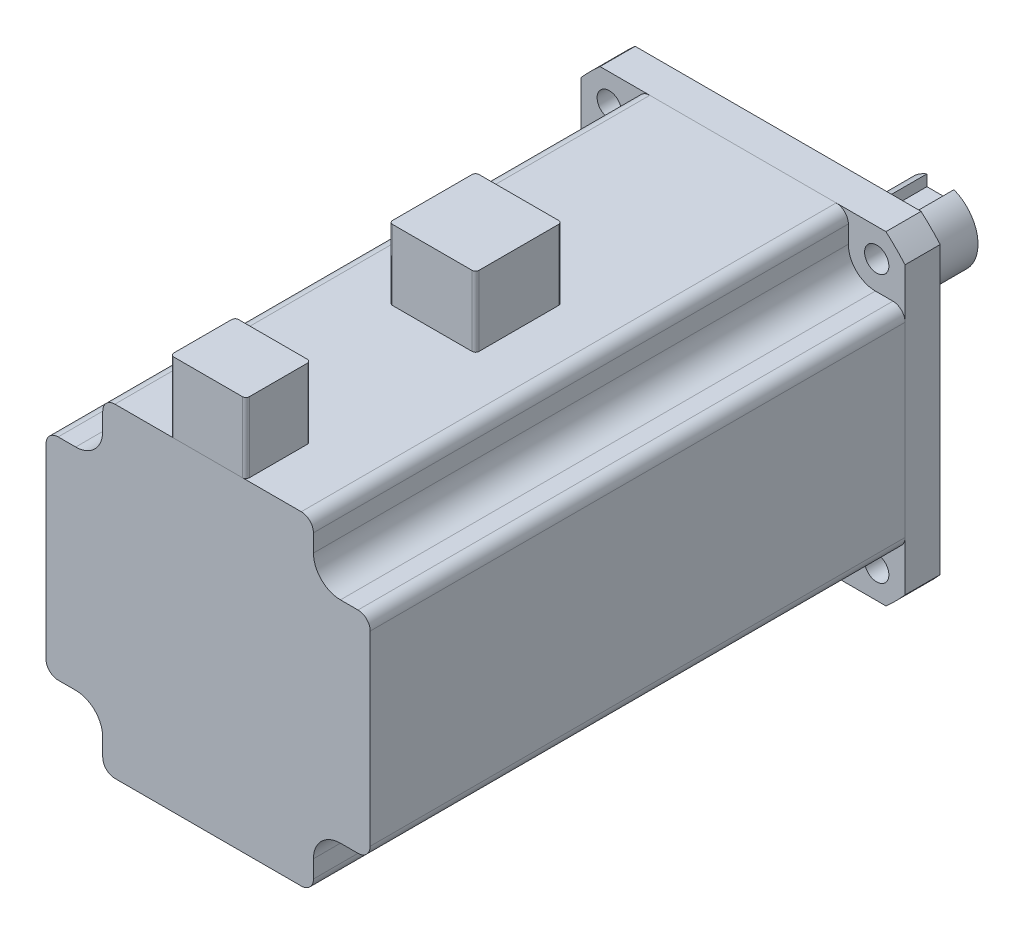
ISO-10303-21;
HEADER;
FILE_DESCRIPTION(('STEP AP214'),'2;1');
FILE_NAME('part.step','',(''),(''),'','','');
FILE_SCHEMA(('AUTOMOTIVE_DESIGN { 1 0 10303 214 1 1 1 1 }'));
ENDSEC;
DATA;
#1=APPLICATION_CONTEXT('core data for automotive mechanical design processes');
#2=APPLICATION_PROTOCOL_DEFINITION('international standard','automotive_design',2000,#1);
#3=PRODUCT_CONTEXT('',#1,'mechanical');
#4=PRODUCT('Part','Part','',(#3));
#5=PRODUCT_RELATED_PRODUCT_CATEGORY('part','',(#4));
#6=PRODUCT_DEFINITION_FORMATION('','',#4);
#7=PRODUCT_DEFINITION_CONTEXT('part definition',#1,'design');
#8=PRODUCT_DEFINITION('design','',#6,#7);
#9=PRODUCT_DEFINITION_SHAPE('','',#8);
#10=(LENGTH_UNIT() NAMED_UNIT(*) SI_UNIT(.MILLI.,.METRE.));
#11=(NAMED_UNIT(*) PLANE_ANGLE_UNIT() SI_UNIT($,.RADIAN.));
#12=(NAMED_UNIT(*) SI_UNIT($,.STERADIAN.) SOLID_ANGLE_UNIT());
#13=UNCERTAINTY_MEASURE_WITH_UNIT(LENGTH_MEASURE(1.E-05),#10,'distance_accuracy_value','');
#14=(GEOMETRIC_REPRESENTATION_CONTEXT(3) GLOBAL_UNCERTAINTY_ASSIGNED_CONTEXT((#13)) GLOBAL_UNIT_ASSIGNED_CONTEXT((#10,
#11,#12)) REPRESENTATION_CONTEXT('',''));
#15=CARTESIAN_POINT('',(0.,0.,0.));
#16=DIRECTION('',(0.,0.,1.));
#17=DIRECTION('',(1.,0.,0.));
#18=AXIS2_PLACEMENT_3D('',#15,#16,#17);
#19=CARTESIAN_POINT('',(-92.8833791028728,15.8148686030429,63.3614832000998));
#20=DIRECTION('',(0.,-1.,0.));
#21=DIRECTION('',(0.,0.,-1.));
#22=AXIS2_PLACEMENT_3D('',#19,#20,#21);
#23=CYLINDRICAL_SURFACE('',#22,0.638516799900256);
#24=CARTESIAN_POINT('',(-92.8833791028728,2.81486860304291,63.3614832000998));
#25=DIRECTION('',(0.,1.,0.));
#26=DIRECTION('',(0.,0.,-1.));
#27=AXIS2_PLACEMENT_3D('',#24,#25,#26);
#28=CIRCLE('',#27,0.638516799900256);
#29=CARTESIAN_POINT('',(-93.5218959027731,2.81486860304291,63.3614832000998));
#30=VERTEX_POINT('',#29);
#31=CARTESIAN_POINT('',(-92.8833791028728,2.81486860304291,64.));
#32=VERTEX_POINT('',#31);
#33=EDGE_CURVE('E142',#30,#32,#28,.T.);
#34=ORIENTED_EDGE('',*,*,#33,.T.);
#35=DIRECTION('',(0.,-1.,0.));
#36=VECTOR('',#35,1.);
#37=CARTESIAN_POINT('',(-92.8833791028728,15.8148686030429,64.));
#38=LINE('',#37,#36);
#39=CARTESIAN_POINT('',(-92.8833791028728,15.8148686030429,64.));
#40=VERTEX_POINT('',#39);
#41=EDGE_CURVE('E12',#40,#32,#38,.T.);
#42=ORIENTED_EDGE('',*,*,#41,.F.);
#43=CARTESIAN_POINT('',(-92.8833791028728,15.8148686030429,63.3614832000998));
#44=DIRECTION('',(0.,1.,0.));
#45=DIRECTION('',(0.,0.,-1.));
#46=AXIS2_PLACEMENT_3D('',#43,#44,#45);
#47=CIRCLE('',#46,0.638516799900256);
#48=CARTESIAN_POINT('',(-93.5218959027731,15.8148686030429,63.3614832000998));
#49=VERTEX_POINT('',#48);
#50=EDGE_CURVE('E156',#49,#40,#47,.T.);
#51=ORIENTED_EDGE('',*,*,#50,.F.);
#52=DIRECTION('',(0.,-1.,0.));
#53=VECTOR('',#52,1.);
#54=CARTESIAN_POINT('',(-93.5218959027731,15.8148686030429,63.3614832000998));
#55=LINE('',#54,#53);
#56=EDGE_CURVE('E138',#49,#30,#55,.T.);
#57=ORIENTED_EDGE('',*,*,#56,.T.);
#58=EDGE_LOOP('',(#34,#42,#51,#57));
#59=FACE_BOUND('',#58,.T.);
#60=ADVANCED_FACE('F46',(#59),#23,.T.);
#61=CARTESIAN_POINT('',(-78.1604127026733,15.8148686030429,64.));
#62=DIRECTION('',(0.,0.,-1.));
#63=DIRECTION('',(-1.,0.,0.));
#64=AXIS2_PLACEMENT_3D('',#61,#62,#63);
#65=PLANE('',#64);
#66=DIRECTION('',(1.,0.,0.));
#67=VECTOR('',#66,1.);
#68=CARTESIAN_POINT('',(-78.1604127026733,2.81486860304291,64.));
#69=LINE('',#68,#67);
#70=CARTESIAN_POINT('',(-78.1604127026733,2.81486860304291,64.));
#71=VERTEX_POINT('',#70);
#72=EDGE_CURVE('E145',#32,#71,#69,.T.);
#73=ORIENTED_EDGE('',*,*,#72,.T.);
#74=DIRECTION('',(0.,-1.,0.));
#75=VECTOR('',#74,1.);
#76=CARTESIAN_POINT('',(-78.1604127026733,15.8148686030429,64.));
#77=LINE('',#76,#75);
#78=CARTESIAN_POINT('',(-78.1604127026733,15.8148686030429,64.));
#79=VERTEX_POINT('',#78);
#80=EDGE_CURVE('E54',#79,#71,#77,.T.);
#81=ORIENTED_EDGE('',*,*,#80,.F.);
#82=DIRECTION('',(1.,0.,0.));
#83=VECTOR('',#82,1.);
#84=CARTESIAN_POINT('',(-78.1604127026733,15.8148686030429,64.));
#85=LINE('',#84,#83);
#86=EDGE_CURVE('E105',#40,#79,#85,.T.);
#87=ORIENTED_EDGE('',*,*,#86,.F.);
#88=ORIENTED_EDGE('',*,*,#41,.T.);
#89=EDGE_LOOP('',(#73,#81,#87,#88));
#90=FACE_BOUND('',#89,.T.);
#91=ADVANCED_FACE('F191',(#90),#65,.F.);
#92=CARTESIAN_POINT('',(-78.1604127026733,15.8148686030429,63.3614832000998));
#93=DIRECTION('',(0.,-1.,0.));
#94=DIRECTION('',(0.,0.,-1.));
#95=AXIS2_PLACEMENT_3D('',#92,#93,#94);
#96=CYLINDRICAL_SURFACE('',#95,0.638516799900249);
#97=CARTESIAN_POINT('',(-78.1604127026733,2.81486860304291,63.3614832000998));
#98=DIRECTION('',(0.,1.,0.));
#99=DIRECTION('',(0.,0.,-1.));
#100=AXIS2_PLACEMENT_3D('',#97,#98,#99);
#101=CIRCLE('',#100,0.638516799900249);
#102=CARTESIAN_POINT('',(-77.5218959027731,2.81486860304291,63.3614832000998));
#103=VERTEX_POINT('',#102);
#104=EDGE_CURVE('E147',#71,#103,#101,.T.);
#105=ORIENTED_EDGE('',*,*,#104,.T.);
#106=DIRECTION('',(0.,-1.,0.));
#107=VECTOR('',#106,1.);
#108=CARTESIAN_POINT('',(-77.5218959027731,15.8148686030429,63.3614832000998));
#109=LINE('',#108,#107);
#110=CARTESIAN_POINT('',(-77.5218959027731,15.8148686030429,63.3614832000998));
#111=VERTEX_POINT('',#110);
#112=EDGE_CURVE('E163',#111,#103,#109,.T.);
#113=ORIENTED_EDGE('',*,*,#112,.F.);
#114=CARTESIAN_POINT('',(-78.1604127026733,15.8148686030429,63.3614832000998));
#115=DIRECTION('',(0.,1.,0.));
#116=DIRECTION('',(0.,0.,-1.));
#117=AXIS2_PLACEMENT_3D('',#114,#115,#116);
#118=CIRCLE('',#117,0.638516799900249);
#119=EDGE_CURVE('E171',#79,#111,#118,.T.);
#120=ORIENTED_EDGE('',*,*,#119,.F.);
#121=ORIENTED_EDGE('',*,*,#80,.T.);
#122=EDGE_LOOP('',(#105,#113,#120,#121));
#123=FACE_BOUND('',#122,.T.);
#124=ADVANCED_FACE('F169',(#123),#96,.T.);
#125=CARTESIAN_POINT('',(-77.5218959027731,15.8148686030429,48.6385167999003));
#126=DIRECTION('',(-1.,0.,0.));
#127=DIRECTION('',(0.,0.,1.));
#128=AXIS2_PLACEMENT_3D('',#125,#126,#127);
#129=PLANE('',#128);
#130=DIRECTION('',(0.,0.,-1.));
#131=VECTOR('',#130,1.);
#132=CARTESIAN_POINT('',(-77.5218959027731,2.81486860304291,48.6385167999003));
#133=LINE('',#132,#131);
#134=CARTESIAN_POINT('',(-77.5218959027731,2.81486860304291,48.6385167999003));
#135=VERTEX_POINT('',#134);
#136=EDGE_CURVE('E149',#103,#135,#133,.T.);
#137=ORIENTED_EDGE('',*,*,#136,.T.);
#138=DIRECTION('',(0.,-1.,0.));
#139=VECTOR('',#138,1.);
#140=CARTESIAN_POINT('',(-77.5218959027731,15.8148686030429,48.6385167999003));
#141=LINE('',#140,#139);
#142=CARTESIAN_POINT('',(-77.5218959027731,15.8148686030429,48.6385167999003));
#143=VERTEX_POINT('',#142);
#144=EDGE_CURVE('E160',#143,#135,#141,.T.);
#145=ORIENTED_EDGE('',*,*,#144,.F.);
#146=DIRECTION('',(0.,0.,-1.));
#147=VECTOR('',#146,1.);
#148=CARTESIAN_POINT('',(-77.5218959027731,15.8148686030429,48.6385167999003));
#149=LINE('',#148,#147);
#150=EDGE_CURVE('E183',#111,#143,#149,.T.);
#151=ORIENTED_EDGE('',*,*,#150,.F.);
#152=ORIENTED_EDGE('',*,*,#112,.T.);
#153=EDGE_LOOP('',(#137,#145,#151,#152));
#154=FACE_BOUND('',#153,.T.);
#155=ADVANCED_FACE('F179',(#154),#129,.F.);
#156=CARTESIAN_POINT('',(-78.1604127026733,15.8148686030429,48.6385167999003));
#157=DIRECTION('',(0.,-1.,0.));
#158=DIRECTION('',(0.,0.,-1.));
#159=AXIS2_PLACEMENT_3D('',#156,#157,#158);
#160=CYLINDRICAL_SURFACE('',#159,0.638516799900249);
#161=CARTESIAN_POINT('',(-78.1604127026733,2.81486860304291,48.6385167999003));
#162=DIRECTION('',(0.,1.,0.));
#163=DIRECTION('',(0.,0.,-1.));
#164=AXIS2_PLACEMENT_3D('',#161,#162,#163);
#165=CIRCLE('',#164,0.638516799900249);
#166=CARTESIAN_POINT('',(-78.1604127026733,2.81486860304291,48.));
#167=VERTEX_POINT('',#166);
#168=EDGE_CURVE('E151',#135,#167,#165,.T.);
#169=ORIENTED_EDGE('',*,*,#168,.T.);
#170=DIRECTION('',(0.,-1.,0.));
#171=VECTOR('',#170,1.);
#172=CARTESIAN_POINT('',(-78.1604127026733,15.8148686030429,48.));
#173=LINE('',#172,#171);
#174=CARTESIAN_POINT('',(-78.1604127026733,15.8148686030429,48.));
#175=VERTEX_POINT('',#174);
#176=EDGE_CURVE('E133',#175,#167,#173,.T.);
#177=ORIENTED_EDGE('',*,*,#176,.F.);
#178=CARTESIAN_POINT('',(-78.1604127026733,15.8148686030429,48.6385167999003));
#179=DIRECTION('',(0.,1.,0.));
#180=DIRECTION('',(0.,0.,-1.));
#181=AXIS2_PLACEMENT_3D('',#178,#179,#180);
#182=CIRCLE('',#181,0.638516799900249);
#183=EDGE_CURVE('E124',#143,#175,#182,.T.);
#184=ORIENTED_EDGE('',*,*,#183,.F.);
#185=ORIENTED_EDGE('',*,*,#144,.T.);
#186=EDGE_LOOP('',(#169,#177,#184,#185));
#187=FACE_BOUND('',#186,.T.);
#188=ADVANCED_FACE('F182',(#187),#160,.T.);
#189=CARTESIAN_POINT('',(-78.1604127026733,15.8148686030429,48.));
#190=DIRECTION('',(0.,0.,1.));
#191=DIRECTION('',(1.,0.,0.));
#192=AXIS2_PLACEMENT_3D('',#189,#190,#191);
#193=PLANE('',#192);
#194=DIRECTION('',(-1.,0.,0.));
#195=VECTOR('',#194,1.);
#196=CARTESIAN_POINT('',(-78.1604127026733,2.81486860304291,48.));
#197=LINE('',#196,#195);
#198=CARTESIAN_POINT('',(-92.8833791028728,2.81486860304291,48.));
#199=VERTEX_POINT('',#198);
#200=EDGE_CURVE('E132',#167,#199,#197,.T.);
#201=ORIENTED_EDGE('',*,*,#200,.T.);
#202=DIRECTION('',(0.,-1.,0.));
#203=VECTOR('',#202,1.);
#204=CARTESIAN_POINT('',(-92.8833791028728,15.8148686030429,48.));
#205=LINE('',#204,#203);
#206=CARTESIAN_POINT('',(-92.8833791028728,15.8148686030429,48.));
#207=VERTEX_POINT('',#206);
#208=EDGE_CURVE('E129',#207,#199,#205,.T.);
#209=ORIENTED_EDGE('',*,*,#208,.F.);
#210=DIRECTION('',(-1.,0.,0.));
#211=VECTOR('',#210,1.);
#212=CARTESIAN_POINT('',(-78.1604127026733,15.8148686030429,48.));
#213=LINE('',#212,#211);
#214=EDGE_CURVE('E118',#175,#207,#213,.T.);
#215=ORIENTED_EDGE('',*,*,#214,.F.);
#216=ORIENTED_EDGE('',*,*,#176,.T.);
#217=EDGE_LOOP('',(#201,#209,#215,#216));
#218=FACE_BOUND('',#217,.T.);
#219=ADVANCED_FACE('F130',(#218),#193,.F.);
#220=CARTESIAN_POINT('',(-92.8833791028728,15.8148686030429,48.6385167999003));
#221=DIRECTION('',(0.,-1.,0.));
#222=DIRECTION('',(0.,0.,-1.));
#223=AXIS2_PLACEMENT_3D('',#220,#221,#222);
#224=CYLINDRICAL_SURFACE('',#223,0.638516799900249);
#225=CARTESIAN_POINT('',(-92.8833791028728,2.81486860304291,48.6385167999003));
#226=DIRECTION('',(0.,1.,0.));
#227=DIRECTION('',(0.,0.,1.));
#228=AXIS2_PLACEMENT_3D('',#225,#226,#227);
#229=CIRCLE('',#228,0.638516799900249);
#230=CARTESIAN_POINT('',(-93.5218959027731,2.81486860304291,48.6385167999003));
#231=VERTEX_POINT('',#230);
#232=EDGE_CURVE('E91',#199,#231,#229,.T.);
#233=ORIENTED_EDGE('',*,*,#232,.T.);
#234=DIRECTION('',(0.,-1.,0.));
#235=VECTOR('',#234,1.);
#236=CARTESIAN_POINT('',(-93.5218959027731,15.8148686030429,48.6385167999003));
#237=LINE('',#236,#235);
#238=CARTESIAN_POINT('',(-93.5218959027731,15.8148686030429,48.6385167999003));
#239=VERTEX_POINT('',#238);
#240=EDGE_CURVE('E134',#239,#231,#237,.T.);
#241=ORIENTED_EDGE('',*,*,#240,.F.);
#242=CARTESIAN_POINT('',(-92.8833791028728,15.8148686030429,48.6385167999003));
#243=DIRECTION('',(0.,1.,0.));
#244=DIRECTION('',(0.,0.,1.));
#245=AXIS2_PLACEMENT_3D('',#242,#243,#244);
#246=CIRCLE('',#245,0.638516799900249);
#247=EDGE_CURVE('E122',#207,#239,#246,.T.);
#248=ORIENTED_EDGE('',*,*,#247,.F.);
#249=ORIENTED_EDGE('',*,*,#208,.T.);
#250=EDGE_LOOP('',(#233,#241,#248,#249));
#251=FACE_BOUND('',#250,.T.);
#252=ADVANCED_FACE('F136',(#251),#224,.T.);
#253=CARTESIAN_POINT('',(-93.5218959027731,15.8148686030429,48.6385167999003));
#254=DIRECTION('',(1.,0.,0.));
#255=DIRECTION('',(0.,0.,-1.));
#256=AXIS2_PLACEMENT_3D('',#253,#254,#255);
#257=PLANE('',#256);
#258=DIRECTION('',(0.,0.,1.));
#259=VECTOR('',#258,1.);
#260=CARTESIAN_POINT('',(-93.5218959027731,2.81486860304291,48.6385167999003));
#261=LINE('',#260,#259);
#262=EDGE_CURVE('E97',#231,#30,#261,.T.);
#263=ORIENTED_EDGE('',*,*,#262,.T.);
#264=ORIENTED_EDGE('',*,*,#56,.F.);
#265=DIRECTION('',(0.,0.,1.));
#266=VECTOR('',#265,1.);
#267=CARTESIAN_POINT('',(-93.5218959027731,15.8148686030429,48.6385167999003));
#268=LINE('',#267,#266);
#269=EDGE_CURVE('E62',#239,#49,#268,.T.);
#270=ORIENTED_EDGE('',*,*,#269,.F.);
#271=ORIENTED_EDGE('',*,*,#240,.T.);
#272=EDGE_LOOP('',(#263,#264,#270,#271));
#273=FACE_BOUND('',#272,.T.);
#274=ADVANCED_FACE('F207',(#273),#257,.F.);
#275=CARTESIAN_POINT('',(-92.8833791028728,15.8148686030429,63.3614832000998));
#276=DIRECTION('',(0.,-1.,0.));
#277=DIRECTION('',(0.,0.,-1.));
#278=AXIS2_PLACEMENT_3D('',#275,#276,#277);
#279=PLANE('',#278);
#280=ORIENTED_EDGE('',*,*,#50,.T.);
#281=ORIENTED_EDGE('',*,*,#86,.T.);
#282=ORIENTED_EDGE('',*,*,#119,.T.);
#283=ORIENTED_EDGE('',*,*,#150,.T.);
#284=ORIENTED_EDGE('',*,*,#183,.T.);
#285=ORIENTED_EDGE('',*,*,#214,.T.);
#286=ORIENTED_EDGE('',*,*,#247,.T.);
#287=ORIENTED_EDGE('',*,*,#269,.T.);
#288=EDGE_LOOP('',(#280,#281,#282,#283,#284,#285,#286,#287));
#289=FACE_BOUND('',#288,.T.);
#290=ADVANCED_FACE('F120',(#289),#279,.F.);
#291=CARTESIAN_POINT('',(-92.8833791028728,2.81486860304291,63.3614832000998));
#292=DIRECTION('',(0.,-1.,0.));
#293=DIRECTION('',(0.,0.,-1.));
#294=AXIS2_PLACEMENT_3D('',#291,#292,#293);
#295=PLANE('',#294);
#296=ORIENTED_EDGE('',*,*,#33,.F.);
#297=ORIENTED_EDGE('',*,*,#262,.F.);
#298=ORIENTED_EDGE('',*,*,#232,.F.);
#299=ORIENTED_EDGE('',*,*,#200,.F.);
#300=ORIENTED_EDGE('',*,*,#168,.F.);
#301=ORIENTED_EDGE('',*,*,#136,.F.);
#302=ORIENTED_EDGE('',*,*,#104,.F.);
#303=ORIENTED_EDGE('',*,*,#72,.F.);
#304=EDGE_LOOP('',(#296,#297,#298,#299,#300,#301,#302,#303));
#305=FACE_BOUND('',#304,.T.);
#306=ADVANCED_FACE('F175',(#305),#295,.T.);
#307=CLOSED_SHELL('',(#60,#91,#124,#155,#188,#219,#252,#274,#290,#306));
#308=MANIFOLD_SOLID_BREP('B2',#307);
#309=CARTESIAN_POINT('',(-91.8833791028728,15.8148686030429,104.8614832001));
#310=DIRECTION('',(0.,-1.,0.));
#311=DIRECTION('',(0.,0.,-1.));
#312=AXIS2_PLACEMENT_3D('',#309,#310,#311);
#313=CYLINDRICAL_SURFACE('',#312,0.638516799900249);
#314=CARTESIAN_POINT('',(-91.8833791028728,2.81486860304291,104.8614832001));
#315=DIRECTION('',(0.,1.,0.));
#316=DIRECTION('',(0.,0.,-1.));
#317=AXIS2_PLACEMENT_3D('',#314,#315,#316);
#318=CIRCLE('',#317,0.638516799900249);
#319=CARTESIAN_POINT('',(-92.5218959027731,2.81486860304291,104.8614832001));
#320=VERTEX_POINT('',#319);
#321=CARTESIAN_POINT('',(-91.8833791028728,2.81486860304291,105.5));
#322=VERTEX_POINT('',#321);
#323=EDGE_CURVE('E380',#320,#322,#318,.T.);
#324=ORIENTED_EDGE('',*,*,#323,.T.);
#325=DIRECTION('',(0.,-1.,0.));
#326=VECTOR('',#325,1.);
#327=CARTESIAN_POINT('',(-91.8833791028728,15.8148686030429,105.5));
#328=LINE('',#327,#326);
#329=CARTESIAN_POINT('',(-91.8833791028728,15.8148686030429,105.5));
#330=VERTEX_POINT('',#329);
#331=EDGE_CURVE('E44',#330,#322,#328,.T.);
#332=ORIENTED_EDGE('',*,*,#331,.F.);
#333=CARTESIAN_POINT('',(-91.8833791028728,15.8148686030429,104.8614832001));
#334=DIRECTION('',(0.,1.,0.));
#335=DIRECTION('',(0.,0.,-1.));
#336=AXIS2_PLACEMENT_3D('',#333,#334,#335);
#337=CIRCLE('',#336,0.638516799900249);
#338=CARTESIAN_POINT('',(-92.5218959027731,15.8148686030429,104.8614832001));
#339=VERTEX_POINT('',#338);
#340=EDGE_CURVE('E394',#339,#330,#337,.T.);
#341=ORIENTED_EDGE('',*,*,#340,.F.);
#342=DIRECTION('',(0.,-1.,0.));
#343=VECTOR('',#342,1.);
#344=CARTESIAN_POINT('',(-92.5218959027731,15.8148686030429,104.8614832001));
#345=LINE('',#344,#343);
#346=EDGE_CURVE('E376',#339,#320,#345,.T.);
#347=ORIENTED_EDGE('',*,*,#346,.T.);
#348=EDGE_LOOP('',(#324,#332,#341,#347));
#349=FACE_BOUND('',#348,.T.);
#350=ADVANCED_FACE('F284',(#349),#313,.T.);
#351=CARTESIAN_POINT('',(-79.1604127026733,15.8148686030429,105.5));
#352=DIRECTION('',(0.,0.,-1.));
#353=DIRECTION('',(-1.,0.,0.));
#354=AXIS2_PLACEMENT_3D('',#351,#352,#353);
#355=PLANE('',#354);
#356=DIRECTION('',(1.,0.,0.));
#357=VECTOR('',#356,1.);
#358=CARTESIAN_POINT('',(-79.1604127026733,2.81486860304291,105.5));
#359=LINE('',#358,#357);
#360=CARTESIAN_POINT('',(-79.1604127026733,2.81486860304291,105.5));
#361=VERTEX_POINT('',#360);
#362=EDGE_CURVE('E383',#322,#361,#359,.T.);
#363=ORIENTED_EDGE('',*,*,#362,.T.);
#364=DIRECTION('',(0.,-1.,0.));
#365=VECTOR('',#364,1.);
#366=CARTESIAN_POINT('',(-79.1604127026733,15.8148686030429,105.5));
#367=LINE('',#366,#365);
#368=CARTESIAN_POINT('',(-79.1604127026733,15.8148686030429,105.5));
#369=VERTEX_POINT('',#368);
#370=EDGE_CURVE('E292',#369,#361,#367,.T.);
#371=ORIENTED_EDGE('',*,*,#370,.F.);
#372=DIRECTION('',(1.,0.,0.));
#373=VECTOR('',#372,1.);
#374=CARTESIAN_POINT('',(-79.1604127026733,15.8148686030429,105.5));
#375=LINE('',#374,#373);
#376=EDGE_CURVE('E343',#330,#369,#375,.T.);
#377=ORIENTED_EDGE('',*,*,#376,.F.);
#378=ORIENTED_EDGE('',*,*,#331,.T.);
#379=EDGE_LOOP('',(#363,#371,#377,#378));
#380=FACE_BOUND('',#379,.T.);
#381=ADVANCED_FACE('F429',(#380),#355,.F.);
#382=CARTESIAN_POINT('',(-79.1604127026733,15.8148686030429,104.8614832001));
#383=DIRECTION('',(0.,-1.,0.));
#384=DIRECTION('',(0.,0.,-1.));
#385=AXIS2_PLACEMENT_3D('',#382,#383,#384);
#386=CYLINDRICAL_SURFACE('',#385,0.638516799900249);
#387=CARTESIAN_POINT('',(-79.1604127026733,2.81486860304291,104.8614832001));
#388=DIRECTION('',(0.,1.,0.));
#389=DIRECTION('',(0.,0.,-1.));
#390=AXIS2_PLACEMENT_3D('',#387,#388,#389);
#391=CIRCLE('',#390,0.638516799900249);
#392=CARTESIAN_POINT('',(-78.5218959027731,2.81486860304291,104.8614832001));
#393=VERTEX_POINT('',#392);
#394=EDGE_CURVE('E385',#361,#393,#391,.T.);
#395=ORIENTED_EDGE('',*,*,#394,.T.);
#396=DIRECTION('',(0.,-1.,0.));
#397=VECTOR('',#396,1.);
#398=CARTESIAN_POINT('',(-78.5218959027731,15.8148686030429,104.8614832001));
#399=LINE('',#398,#397);
#400=CARTESIAN_POINT('',(-78.5218959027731,15.8148686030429,104.8614832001));
#401=VERTEX_POINT('',#400);
#402=EDGE_CURVE('E401',#401,#393,#399,.T.);
#403=ORIENTED_EDGE('',*,*,#402,.F.);
#404=CARTESIAN_POINT('',(-79.1604127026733,15.8148686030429,104.8614832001));
#405=DIRECTION('',(0.,1.,0.));
#406=DIRECTION('',(0.,0.,-1.));
#407=AXIS2_PLACEMENT_3D('',#404,#405,#406);
#408=CIRCLE('',#407,0.638516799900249);
#409=EDGE_CURVE('E409',#369,#401,#408,.T.);
#410=ORIENTED_EDGE('',*,*,#409,.F.);
#411=ORIENTED_EDGE('',*,*,#370,.T.);
#412=EDGE_LOOP('',(#395,#403,#410,#411));
#413=FACE_BOUND('',#412,.T.);
#414=ADVANCED_FACE('F407',(#413),#386,.T.);
#415=CARTESIAN_POINT('',(-78.5218959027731,15.8148686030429,94.1385167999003));
#416=DIRECTION('',(-1.,0.,0.));
#417=DIRECTION('',(0.,0.,1.));
#418=AXIS2_PLACEMENT_3D('',#415,#416,#417);
#419=PLANE('',#418);
#420=DIRECTION('',(0.,0.,-1.));
#421=VECTOR('',#420,1.);
#422=CARTESIAN_POINT('',(-78.5218959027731,2.81486860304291,94.1385167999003));
#423=LINE('',#422,#421);
#424=CARTESIAN_POINT('',(-78.5218959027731,2.81486860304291,94.1385167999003));
#425=VERTEX_POINT('',#424);
#426=EDGE_CURVE('E387',#393,#425,#423,.T.);
#427=ORIENTED_EDGE('',*,*,#426,.T.);
#428=DIRECTION('',(0.,-1.,0.));
#429=VECTOR('',#428,1.);
#430=CARTESIAN_POINT('',(-78.5218959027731,15.8148686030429,94.1385167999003));
#431=LINE('',#430,#429);
#432=CARTESIAN_POINT('',(-78.5218959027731,15.8148686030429,94.1385167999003));
#433=VERTEX_POINT('',#432);
#434=EDGE_CURVE('E398',#433,#425,#431,.T.);
#435=ORIENTED_EDGE('',*,*,#434,.F.);
#436=DIRECTION('',(0.,0.,-1.));
#437=VECTOR('',#436,1.);
#438=CARTESIAN_POINT('',(-78.5218959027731,15.8148686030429,94.1385167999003));
#439=LINE('',#438,#437);
#440=EDGE_CURVE('E421',#401,#433,#439,.T.);
#441=ORIENTED_EDGE('',*,*,#440,.F.);
#442=ORIENTED_EDGE('',*,*,#402,.T.);
#443=EDGE_LOOP('',(#427,#435,#441,#442));
#444=FACE_BOUND('',#443,.T.);
#445=ADVANCED_FACE('F417',(#444),#419,.F.);
#446=CARTESIAN_POINT('',(-79.1604127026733,15.8148686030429,94.1385167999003));
#447=DIRECTION('',(0.,-1.,0.));
#448=DIRECTION('',(0.,0.,-1.));
#449=AXIS2_PLACEMENT_3D('',#446,#447,#448);
#450=CYLINDRICAL_SURFACE('',#449,0.638516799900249);
#451=CARTESIAN_POINT('',(-79.1604127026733,2.81486860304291,94.1385167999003));
#452=DIRECTION('',(0.,1.,0.));
#453=DIRECTION('',(0.,0.,-1.));
#454=AXIS2_PLACEMENT_3D('',#451,#452,#453);
#455=CIRCLE('',#454,0.638516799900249);
#456=CARTESIAN_POINT('',(-79.1604127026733,2.81486860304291,93.5));
#457=VERTEX_POINT('',#456);
#458=EDGE_CURVE('E389',#425,#457,#455,.T.);
#459=ORIENTED_EDGE('',*,*,#458,.T.);
#460=DIRECTION('',(0.,-1.,0.));
#461=VECTOR('',#460,1.);
#462=CARTESIAN_POINT('',(-79.1604127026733,15.8148686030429,93.5));
#463=LINE('',#462,#461);
#464=CARTESIAN_POINT('',(-79.1604127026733,15.8148686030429,93.5));
#465=VERTEX_POINT('',#464);
#466=EDGE_CURVE('E371',#465,#457,#463,.T.);
#467=ORIENTED_EDGE('',*,*,#466,.F.);
#468=CARTESIAN_POINT('',(-79.1604127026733,15.8148686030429,94.1385167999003));
#469=DIRECTION('',(0.,1.,0.));
#470=DIRECTION('',(0.,0.,-1.));
#471=AXIS2_PLACEMENT_3D('',#468,#469,#470);
#472=CIRCLE('',#471,0.638516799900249);
#473=EDGE_CURVE('E362',#433,#465,#472,.T.);
#474=ORIENTED_EDGE('',*,*,#473,.F.);
#475=ORIENTED_EDGE('',*,*,#434,.T.);
#476=EDGE_LOOP('',(#459,#467,#474,#475));
#477=FACE_BOUND('',#476,.T.);
#478=ADVANCED_FACE('F420',(#477),#450,.T.);
#479=CARTESIAN_POINT('',(-79.1604127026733,15.8148686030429,93.5));
#480=DIRECTION('',(0.,0.,1.));
#481=DIRECTION('',(1.,0.,0.));
#482=AXIS2_PLACEMENT_3D('',#479,#480,#481);
#483=PLANE('',#482);
#484=DIRECTION('',(-1.,0.,0.));
#485=VECTOR('',#484,1.);
#486=CARTESIAN_POINT('',(-79.1604127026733,2.81486860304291,93.5));
#487=LINE('',#486,#485);
#488=CARTESIAN_POINT('',(-91.8833791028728,2.81486860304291,93.5));
#489=VERTEX_POINT('',#488);
#490=EDGE_CURVE('E370',#457,#489,#487,.T.);
#491=ORIENTED_EDGE('',*,*,#490,.T.);
#492=DIRECTION('',(0.,-1.,0.));
#493=VECTOR('',#492,1.);
#494=CARTESIAN_POINT('',(-91.8833791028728,15.8148686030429,93.5));
#495=LINE('',#494,#493);
#496=CARTESIAN_POINT('',(-91.8833791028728,15.8148686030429,93.5));
#497=VERTEX_POINT('',#496);
#498=EDGE_CURVE('E367',#497,#489,#495,.T.);
#499=ORIENTED_EDGE('',*,*,#498,.F.);
#500=DIRECTION('',(-1.,0.,0.));
#501=VECTOR('',#500,1.);
#502=CARTESIAN_POINT('',(-79.1604127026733,15.8148686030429,93.5));
#503=LINE('',#502,#501);
#504=EDGE_CURVE('E356',#465,#497,#503,.T.);
#505=ORIENTED_EDGE('',*,*,#504,.F.);
#506=ORIENTED_EDGE('',*,*,#466,.T.);
#507=EDGE_LOOP('',(#491,#499,#505,#506));
#508=FACE_BOUND('',#507,.T.);
#509=ADVANCED_FACE('F368',(#508),#483,.F.);
#510=CARTESIAN_POINT('',(-91.8833791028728,15.8148686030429,94.1385167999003));
#511=DIRECTION('',(0.,-1.,0.));
#512=DIRECTION('',(0.,0.,-1.));
#513=AXIS2_PLACEMENT_3D('',#510,#511,#512);
#514=CYLINDRICAL_SURFACE('',#513,0.638516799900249);
#515=CARTESIAN_POINT('',(-91.8833791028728,2.81486860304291,94.1385167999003));
#516=DIRECTION('',(0.,1.,0.));
#517=DIRECTION('',(0.,0.,1.));
#518=AXIS2_PLACEMENT_3D('',#515,#516,#517);
#519=CIRCLE('',#518,0.638516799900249);
#520=CARTESIAN_POINT('',(-92.5218959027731,2.81486860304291,94.1385167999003));
#521=VERTEX_POINT('',#520);
#522=EDGE_CURVE('E329',#489,#521,#519,.T.);
#523=ORIENTED_EDGE('',*,*,#522,.T.);
#524=DIRECTION('',(0.,-1.,0.));
#525=VECTOR('',#524,1.);
#526=CARTESIAN_POINT('',(-92.5218959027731,15.8148686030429,94.1385167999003));
#527=LINE('',#526,#525);
#528=CARTESIAN_POINT('',(-92.5218959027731,15.8148686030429,94.1385167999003));
#529=VERTEX_POINT('',#528);
#530=EDGE_CURVE('E372',#529,#521,#527,.T.);
#531=ORIENTED_EDGE('',*,*,#530,.F.);
#532=CARTESIAN_POINT('',(-91.8833791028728,15.8148686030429,94.1385167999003));
#533=DIRECTION('',(0.,1.,0.));
#534=DIRECTION('',(0.,0.,1.));
#535=AXIS2_PLACEMENT_3D('',#532,#533,#534);
#536=CIRCLE('',#535,0.638516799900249);
#537=EDGE_CURVE('E360',#497,#529,#536,.T.);
#538=ORIENTED_EDGE('',*,*,#537,.F.);
#539=ORIENTED_EDGE('',*,*,#498,.T.);
#540=EDGE_LOOP('',(#523,#531,#538,#539));
#541=FACE_BOUND('',#540,.T.);
#542=ADVANCED_FACE('F374',(#541),#514,.T.);
#543=CARTESIAN_POINT('',(-92.5218959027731,15.8148686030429,94.1385167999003));
#544=DIRECTION('',(1.,0.,0.));
#545=DIRECTION('',(0.,0.,-1.));
#546=AXIS2_PLACEMENT_3D('',#543,#544,#545);
#547=PLANE('',#546);
#548=DIRECTION('',(0.,0.,1.));
#549=VECTOR('',#548,1.);
#550=CARTESIAN_POINT('',(-92.5218959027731,2.81486860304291,94.1385167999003));
#551=LINE('',#550,#549);
#552=EDGE_CURVE('E335',#521,#320,#551,.T.);
#553=ORIENTED_EDGE('',*,*,#552,.T.);
#554=ORIENTED_EDGE('',*,*,#346,.F.);
#555=DIRECTION('',(0.,0.,1.));
#556=VECTOR('',#555,1.);
#557=CARTESIAN_POINT('',(-92.5218959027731,15.8148686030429,94.1385167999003));
#558=LINE('',#557,#556);
#559=EDGE_CURVE('E300',#529,#339,#558,.T.);
#560=ORIENTED_EDGE('',*,*,#559,.F.);
#561=ORIENTED_EDGE('',*,*,#530,.T.);
#562=EDGE_LOOP('',(#553,#554,#560,#561));
#563=FACE_BOUND('',#562,.T.);
#564=ADVANCED_FACE('F445',(#563),#547,.F.);
#565=CARTESIAN_POINT('',(-91.8833791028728,15.8148686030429,104.8614832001));
#566=DIRECTION('',(0.,-1.,0.));
#567=DIRECTION('',(0.,0.,-1.));
#568=AXIS2_PLACEMENT_3D('',#565,#566,#567);
#569=PLANE('',#568);
#570=ORIENTED_EDGE('',*,*,#340,.T.);
#571=ORIENTED_EDGE('',*,*,#376,.T.);
#572=ORIENTED_EDGE('',*,*,#409,.T.);
#573=ORIENTED_EDGE('',*,*,#440,.T.);
#574=ORIENTED_EDGE('',*,*,#473,.T.);
#575=ORIENTED_EDGE('',*,*,#504,.T.);
#576=ORIENTED_EDGE('',*,*,#537,.T.);
#577=ORIENTED_EDGE('',*,*,#559,.T.);
#578=EDGE_LOOP('',(#570,#571,#572,#573,#574,#575,#576,#577));
#579=FACE_BOUND('',#578,.T.);
#580=ADVANCED_FACE('F358',(#579),#569,.F.);
#581=CARTESIAN_POINT('',(-91.8833791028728,2.81486860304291,104.8614832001));
#582=DIRECTION('',(0.,-1.,0.));
#583=DIRECTION('',(0.,0.,-1.));
#584=AXIS2_PLACEMENT_3D('',#581,#582,#583);
#585=PLANE('',#584);
#586=ORIENTED_EDGE('',*,*,#323,.F.);
#587=ORIENTED_EDGE('',*,*,#552,.F.);
#588=ORIENTED_EDGE('',*,*,#522,.F.);
#589=ORIENTED_EDGE('',*,*,#490,.F.);
#590=ORIENTED_EDGE('',*,*,#458,.F.);
#591=ORIENTED_EDGE('',*,*,#426,.F.);
#592=ORIENTED_EDGE('',*,*,#394,.F.);
#593=ORIENTED_EDGE('',*,*,#362,.F.);
#594=EDGE_LOOP('',(#586,#587,#588,#589,#590,#591,#592,#593));
#595=FACE_BOUND('',#594,.T.);
#596=ADVANCED_FACE('F413',(#595),#585,.T.);
#597=CLOSED_SHELL('',(#350,#381,#414,#445,#478,#509,#542,#564,#580,#596));
#598=MANIFOLD_SOLID_BREP('B6',#597);
#599=CARTESIAN_POINT('',(-61.0218959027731,-51.6851313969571,105.5));
#600=DIRECTION('',(0.,0.,-1.));
#601=DIRECTION('',(-1.,0.,0.));
#602=AXIS2_PLACEMENT_3D('',#599,#600,#601);
#603=CYLINDRICAL_SURFACE('',#602,5.);
#604=CARTESIAN_POINT('',(-61.0218959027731,-51.6851313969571,6.5));
#605=DIRECTION('',(0.,0.,-1.));
#606=DIRECTION('',(1.,0.,0.));
#607=AXIS2_PLACEMENT_3D('',#604,#605,#606);
#608=CIRCLE('',#607,5.);
#609=CARTESIAN_POINT('',(-66.0218959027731,-51.6851313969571,6.5));
#610=VERTEX_POINT('',#609);
#611=CARTESIAN_POINT('',(-61.021895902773,-46.6851313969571,6.5));
#612=VERTEX_POINT('',#611);
#613=EDGE_CURVE('E713',#610,#612,#608,.T.);
#614=ORIENTED_EDGE('',*,*,#613,.T.);
#615=DIRECTION('',(0.,0.,-1.));
#616=VECTOR('',#615,1.);
#617=CARTESIAN_POINT('',(-61.021895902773,-46.6851313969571,105.5));
#618=LINE('',#617,#616);
#619=CARTESIAN_POINT('',(-61.021895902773,-46.6851313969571,105.5));
#620=VERTEX_POINT('',#619);
#621=EDGE_CURVE('E282',#620,#612,#618,.T.);
#622=ORIENTED_EDGE('',*,*,#621,.F.);
#623=CARTESIAN_POINT('',(-61.0218959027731,-51.6851313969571,105.5));
#624=DIRECTION('',(0.,0.,-1.));
#625=DIRECTION('',(1.,0.,0.));
#626=AXIS2_PLACEMENT_3D('',#623,#624,#625);
#627=CIRCLE('',#626,5.);
#628=CARTESIAN_POINT('',(-66.0218959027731,-51.6851313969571,105.5));
#629=VERTEX_POINT('',#628);
#630=EDGE_CURVE('E759',#629,#620,#627,.T.);
#631=ORIENTED_EDGE('',*,*,#630,.F.);
#632=DIRECTION('',(0.,0.,-1.));
#633=VECTOR('',#632,1.);
#634=CARTESIAN_POINT('',(-66.0218959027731,-51.6851313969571,105.5));
#635=LINE('',#634,#633);
#636=EDGE_CURVE('E709',#629,#610,#635,.T.);
#637=ORIENTED_EDGE('',*,*,#636,.T.);
#638=EDGE_LOOP('',(#614,#622,#631,#637));
#639=FACE_BOUND('',#638,.T.);
#640=ADVANCED_FACE('F521',(#639),#603,.F.);
#641=CARTESIAN_POINT('',(-61.021895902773,-46.6851313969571,105.5));
#642=DIRECTION('',(0.,1.,0.));
#643=DIRECTION('',(0.,0.,1.));
#644=AXIS2_PLACEMENT_3D('',#641,#642,#643);
#645=PLANE('',#644);
#646=DIRECTION('',(1.,0.,0.));
#647=VECTOR('',#646,1.);
#648=CARTESIAN_POINT('',(-61.021895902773,-46.6851313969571,6.5));
#649=LINE('',#648,#647);
#650=CARTESIAN_POINT('',(-57.7761754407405,-46.6851313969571,6.5));
#651=VERTEX_POINT('',#650);
#652=EDGE_CURVE('E716',#612,#651,#649,.T.);
#653=ORIENTED_EDGE('',*,*,#652,.T.);
#654=DIRECTION('',(0.,0.,-1.));
#655=VECTOR('',#654,1.);
#656=CARTESIAN_POINT('',(-57.7761754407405,-46.6851313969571,105.5));
#657=LINE('',#656,#655);
#658=CARTESIAN_POINT('',(-57.7761754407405,-46.6851313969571,105.5));
#659=VERTEX_POINT('',#658);
#660=EDGE_CURVE('E529',#659,#651,#657,.T.);
#661=ORIENTED_EDGE('',*,*,#660,.F.);
#662=DIRECTION('',(1.,0.,0.));
#663=VECTOR('',#662,1.);
#664=CARTESIAN_POINT('',(-61.021895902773,-46.6851313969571,105.5));
#665=LINE('',#664,#663);
#666=EDGE_CURVE('E628',#620,#659,#665,.T.);
#667=ORIENTED_EDGE('',*,*,#666,.F.);
#668=ORIENTED_EDGE('',*,*,#621,.T.);
#669=EDGE_LOOP('',(#653,#661,#667,#668));
#670=FACE_BOUND('',#669,.T.);
#671=ADVANCED_FACE('F897',(#670),#645,.F.);
#672=CARTESIAN_POINT('',(-57.7761754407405,-44.4308518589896,105.5));
#673=DIRECTION('',(0.,0.,-1.));
#674=DIRECTION('',(-1.,0.,0.));
#675=AXIS2_PLACEMENT_3D('',#672,#673,#674);
#676=CYLINDRICAL_SURFACE('',#675,2.25427953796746);
#677=CARTESIAN_POINT('',(-57.7761754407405,-44.4308518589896,6.5));
#678=DIRECTION('',(0.,0.,1.));
#679=DIRECTION('',(-1.,0.,0.));
#680=AXIS2_PLACEMENT_3D('',#677,#678,#679);
#681=CIRCLE('',#680,2.25427953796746);
#682=CARTESIAN_POINT('',(-55.5218959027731,-44.4308518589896,6.5));
#683=VERTEX_POINT('',#682);
#684=EDGE_CURVE('E718',#651,#683,#681,.T.);
#685=ORIENTED_EDGE('',*,*,#684,.T.);
#686=DIRECTION('',(0.,0.,-1.));
#687=VECTOR('',#686,1.);
#688=CARTESIAN_POINT('',(-55.5218959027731,-44.4308518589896,105.5));
#689=LINE('',#688,#687);
#690=CARTESIAN_POINT('',(-55.5218959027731,-44.4308518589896,105.5));
#691=VERTEX_POINT('',#690);
#692=EDGE_CURVE('E814',#691,#683,#689,.T.);
#693=ORIENTED_EDGE('',*,*,#692,.F.);
#694=CARTESIAN_POINT('',(-57.7761754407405,-44.4308518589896,105.5));
#695=DIRECTION('',(0.,0.,1.));
#696=DIRECTION('',(-1.,0.,0.));
#697=AXIS2_PLACEMENT_3D('',#694,#695,#696);
#698=CIRCLE('',#697,2.25427953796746);
#699=EDGE_CURVE('E822',#659,#691,#698,.T.);
#700=ORIENTED_EDGE('',*,*,#699,.F.);
#701=ORIENTED_EDGE('',*,*,#660,.T.);
#702=EDGE_LOOP('',(#685,#693,#700,#701));
#703=FACE_BOUND('',#702,.T.);
#704=ADVANCED_FACE('F820',(#703),#676,.T.);
#705=CARTESIAN_POINT('',(-55.5218959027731,-9.93941093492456,105.5));
#706=DIRECTION('',(-1.,0.,0.));
#707=DIRECTION('',(0.,0.,1.));
#708=AXIS2_PLACEMENT_3D('',#705,#706,#707);
#709=PLANE('',#708);
#710=DIRECTION('',(0.,1.,0.));
#711=VECTOR('',#710,1.);
#712=CARTESIAN_POINT('',(-55.5218959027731,-9.93941093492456,6.5));
#713=LINE('',#712,#711);
#714=CARTESIAN_POINT('',(-55.5218959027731,-9.93941093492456,6.5));
#715=VERTEX_POINT('',#714);
#716=EDGE_CURVE('E720',#683,#715,#713,.T.);
#717=ORIENTED_EDGE('',*,*,#716,.T.);
#718=DIRECTION('',(0.,0.,-1.));
#719=VECTOR('',#718,1.);
#720=CARTESIAN_POINT('',(-55.5218959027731,-9.93941093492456,105.5));
#721=LINE('',#720,#719);
#722=CARTESIAN_POINT('',(-55.5218959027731,-9.93941093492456,105.5));
#723=VERTEX_POINT('',#722);
#724=EDGE_CURVE('E811',#723,#715,#721,.T.);
#725=ORIENTED_EDGE('',*,*,#724,.F.);
#726=DIRECTION('',(0.,1.,0.));
#727=VECTOR('',#726,1.);
#728=CARTESIAN_POINT('',(-55.5218959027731,-9.93941093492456,105.5));
#729=LINE('',#728,#727);
#730=EDGE_CURVE('E840',#691,#723,#729,.T.);
#731=ORIENTED_EDGE('',*,*,#730,.F.);
#732=ORIENTED_EDGE('',*,*,#692,.T.);
#733=EDGE_LOOP('',(#717,#725,#731,#732));
#734=FACE_BOUND('',#733,.T.);
#735=ADVANCED_FACE('F831',(#734),#709,.F.);
#736=CARTESIAN_POINT('',(-57.7761754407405,-9.93941093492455,105.5));
#737=DIRECTION('',(0.,0.,-1.));
#738=DIRECTION('',(-1.,0.,0.));
#739=AXIS2_PLACEMENT_3D('',#736,#737,#738);
#740=CYLINDRICAL_SURFACE('',#739,2.25427953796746);
#741=CARTESIAN_POINT('',(-57.7761754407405,-9.93941093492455,6.5));
#742=DIRECTION('',(0.,0.,1.));
#743=DIRECTION('',(1.,0.,0.));
#744=AXIS2_PLACEMENT_3D('',#741,#742,#743);
#745=CIRCLE('',#744,2.25427953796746);
#746=CARTESIAN_POINT('',(-57.7761754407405,-7.68513139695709,6.5));
#747=VERTEX_POINT('',#746);
#748=EDGE_CURVE('E722',#715,#747,#745,.T.);
#749=ORIENTED_EDGE('',*,*,#748,.T.);
#750=DIRECTION('',(0.,0.,-1.));
#751=VECTOR('',#750,1.);
#752=CARTESIAN_POINT('',(-57.7761754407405,-7.68513139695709,105.5));
#753=LINE('',#752,#751);
#754=CARTESIAN_POINT('',(-57.7761754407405,-7.68513139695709,105.5));
#755=VERTEX_POINT('',#754);
#756=EDGE_CURVE('E808',#755,#747,#753,.T.);
#757=ORIENTED_EDGE('',*,*,#756,.F.);
#758=CARTESIAN_POINT('',(-57.7761754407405,-9.93941093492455,105.5));
#759=DIRECTION('',(0.,0.,1.));
#760=DIRECTION('',(1.,0.,0.));
#761=AXIS2_PLACEMENT_3D('',#758,#759,#760);
#762=CIRCLE('',#761,2.25427953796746);
#763=EDGE_CURVE('E837',#723,#755,#762,.T.);
#764=ORIENTED_EDGE('',*,*,#763,.F.);
#765=ORIENTED_EDGE('',*,*,#724,.T.);
#766=EDGE_LOOP('',(#749,#757,#764,#765));
#767=FACE_BOUND('',#766,.T.);
#768=ADVANCED_FACE('F835',(#767),#740,.T.);
#769=CARTESIAN_POINT('',(-61.021895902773,-7.68513139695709,105.5));
#770=DIRECTION('',(0.,-1.,0.));
#771=DIRECTION('',(1.,0.,0.));
#772=AXIS2_PLACEMENT_3D('',#769,#770,#771);
#773=PLANE('',#772);
#774=DIRECTION('',(-1.,0.,0.));
#775=VECTOR('',#774,1.);
#776=CARTESIAN_POINT('',(-61.021895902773,-7.68513139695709,6.5));
#777=LINE('',#776,#775);
#778=CARTESIAN_POINT('',(-61.021895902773,-7.68513139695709,6.5));
#779=VERTEX_POINT('',#778);
#780=EDGE_CURVE('E724',#747,#779,#777,.T.);
#781=ORIENTED_EDGE('',*,*,#780,.T.);
#782=DIRECTION('',(0.,0.,-1.));
#783=VECTOR('',#782,1.);
#784=CARTESIAN_POINT('',(-61.021895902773,-7.68513139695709,105.5));
#785=LINE('',#784,#783);
#786=CARTESIAN_POINT('',(-61.021895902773,-7.68513139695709,105.5));
#787=VERTEX_POINT('',#786);
#788=EDGE_CURVE('E805',#787,#779,#785,.T.);
#789=ORIENTED_EDGE('',*,*,#788,.F.);
#790=DIRECTION('',(-1.,0.,0.));
#791=VECTOR('',#790,1.);
#792=CARTESIAN_POINT('',(-61.021895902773,-7.68513139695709,105.5));
#793=LINE('',#792,#791);
#794=EDGE_CURVE('E839',#755,#787,#793,.T.);
#795=ORIENTED_EDGE('',*,*,#794,.F.);
#796=ORIENTED_EDGE('',*,*,#756,.T.);
#797=EDGE_LOOP('',(#781,#789,#795,#796));
#798=FACE_BOUND('',#797,.T.);
#799=ADVANCED_FACE('F910',(#798),#773,.F.);
#800=CARTESIAN_POINT('',(-61.0218959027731,-2.68513139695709,105.5));
#801=DIRECTION('',(0.,0.,-1.));
#802=DIRECTION('',(-1.,0.,0.));
#803=AXIS2_PLACEMENT_3D('',#800,#801,#802);
#804=CYLINDRICAL_SURFACE('',#803,5.);
#805=CARTESIAN_POINT('',(-61.0218959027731,-2.68513139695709,6.5));
#806=DIRECTION('',(0.,0.,-1.));
#807=DIRECTION('',(-1.,0.,0.));
#808=AXIS2_PLACEMENT_3D('',#805,#806,#807);
#809=CIRCLE('',#808,5.);
#810=CARTESIAN_POINT('',(-66.0218959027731,-2.68513139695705,6.5));
#811=VERTEX_POINT('',#810);
#812=EDGE_CURVE('E726',#779,#811,#809,.T.);
#813=ORIENTED_EDGE('',*,*,#812,.T.);
#814=DIRECTION('',(0.,0.,-1.));
#815=VECTOR('',#814,1.);
#816=CARTESIAN_POINT('',(-66.0218959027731,-2.68513139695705,105.5));
#817=LINE('',#816,#815);
#818=CARTESIAN_POINT('',(-66.0218959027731,-2.68513139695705,105.5));
#819=VERTEX_POINT('',#818);
#820=EDGE_CURVE('E802',#819,#811,#817,.T.);
#821=ORIENTED_EDGE('',*,*,#820,.F.);
#822=CARTESIAN_POINT('',(-61.0218959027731,-2.68513139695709,105.5));
#823=DIRECTION('',(0.,0.,-1.));
#824=DIRECTION('',(-1.,0.,0.));
#825=AXIS2_PLACEMENT_3D('',#822,#823,#824);
#826=CIRCLE('',#825,5.);
#827=EDGE_CURVE('E842',#787,#819,#826,.T.);
#828=ORIENTED_EDGE('',*,*,#827,.F.);
#829=ORIENTED_EDGE('',*,*,#788,.T.);
#830=EDGE_LOOP('',(#813,#821,#828,#829));
#831=FACE_BOUND('',#830,.T.);
#832=ADVANCED_FACE('F913',(#831),#804,.F.);
#833=CARTESIAN_POINT('',(-66.0218959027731,0.560589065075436,105.5));
#834=DIRECTION('',(-1.,0.,0.));
#835=DIRECTION('',(0.,0.,1.));
#836=AXIS2_PLACEMENT_3D('',#833,#834,#835);
#837=PLANE('',#836);
#838=DIRECTION('',(0.,1.,0.));
#839=VECTOR('',#838,1.);
#840=CARTESIAN_POINT('',(-66.0218959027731,0.560589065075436,6.5));
#841=LINE('',#840,#839);
#842=CARTESIAN_POINT('',(-66.0218959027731,0.560589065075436,6.5));
#843=VERTEX_POINT('',#842);
#844=EDGE_CURVE('E728',#811,#843,#841,.T.);
#845=ORIENTED_EDGE('',*,*,#844,.T.);
#846=DIRECTION('',(0.,0.,-1.));
#847=VECTOR('',#846,1.);
#848=CARTESIAN_POINT('',(-66.0218959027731,0.560589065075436,105.5));
#849=LINE('',#848,#847);
#850=CARTESIAN_POINT('',(-66.0218959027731,0.560589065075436,105.5));
#851=VERTEX_POINT('',#850);
#852=EDGE_CURVE('E799',#851,#843,#849,.T.);
#853=ORIENTED_EDGE('',*,*,#852,.F.);
#854=DIRECTION('',(0.,1.,0.));
#855=VECTOR('',#854,1.);
#856=CARTESIAN_POINT('',(-66.0218959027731,0.560589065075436,105.5));
#857=LINE('',#856,#855);
#858=EDGE_CURVE('E848',#819,#851,#857,.T.);
#859=ORIENTED_EDGE('',*,*,#858,.F.);
#860=ORIENTED_EDGE('',*,*,#820,.T.);
#861=EDGE_LOOP('',(#845,#853,#859,#860));
#862=FACE_BOUND('',#861,.T.);
#863=ADVANCED_FACE('F917',(#862),#837,.F.);
#864=CARTESIAN_POINT('',(-68.2761754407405,0.560589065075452,105.5));
#865=DIRECTION('',(0.,0.,-1.));
#866=DIRECTION('',(-1.,0.,0.));
#867=AXIS2_PLACEMENT_3D('',#864,#865,#866);
#868=CYLINDRICAL_SURFACE('',#867,2.25427953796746);
#869=CARTESIAN_POINT('',(-68.2761754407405,0.560589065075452,6.5));
#870=DIRECTION('',(0.,0.,1.));
#871=DIRECTION('',(1.,0.,0.));
#872=AXIS2_PLACEMENT_3D('',#869,#870,#871);
#873=CIRCLE('',#872,2.25427953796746);
#874=CARTESIAN_POINT('',(-68.2761754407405,2.81486860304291,6.5));
#875=VERTEX_POINT('',#874);
#876=EDGE_CURVE('E730',#843,#875,#873,.T.);
#877=ORIENTED_EDGE('',*,*,#876,.T.);
#878=DIRECTION('',(0.,0.,-1.));
#879=VECTOR('',#878,1.);
#880=CARTESIAN_POINT('',(-68.2761754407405,2.81486860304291,105.5));
#881=LINE('',#880,#879);
#882=CARTESIAN_POINT('',(-68.2761754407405,2.81486860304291,105.5));
#883=VERTEX_POINT('',#882);
#884=EDGE_CURVE('E796',#883,#875,#881,.T.);
#885=ORIENTED_EDGE('',*,*,#884,.F.);
#886=CARTESIAN_POINT('',(-68.2761754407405,0.560589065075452,105.5));
#887=DIRECTION('',(0.,0.,1.));
#888=DIRECTION('',(1.,0.,0.));
#889=AXIS2_PLACEMENT_3D('',#886,#887,#888);
#890=CIRCLE('',#889,2.25427953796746);
#891=EDGE_CURVE('E850',#851,#883,#890,.T.);
#892=ORIENTED_EDGE('',*,*,#891,.F.);
#893=ORIENTED_EDGE('',*,*,#852,.T.);
#894=EDGE_LOOP('',(#877,#885,#892,#893));
#895=FACE_BOUND('',#894,.T.);
#896=ADVANCED_FACE('F921',(#895),#868,.T.);
#897=CARTESIAN_POINT('',(-68.2761754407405,2.81486860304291,105.5));
#898=DIRECTION('',(0.,-1.,0.));
#899=DIRECTION('',(0.,0.,-1.));
#900=AXIS2_PLACEMENT_3D('',#897,#898,#899);
#901=PLANE('',#900);
#902=DIRECTION('',(-1.,0.,0.));
#903=VECTOR('',#902,1.);
#904=CARTESIAN_POINT('',(-68.2761754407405,2.81486860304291,6.5));
#905=LINE('',#904,#903);
#906=CARTESIAN_POINT('',(-102.767616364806,2.81486860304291,6.5));
#907=VERTEX_POINT('',#906);
#908=EDGE_CURVE('E732',#875,#907,#905,.T.);
#909=ORIENTED_EDGE('',*,*,#908,.T.);
#910=DIRECTION('',(0.,0.,-1.));
#911=VECTOR('',#910,1.);
#912=CARTESIAN_POINT('',(-102.767616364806,2.81486860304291,105.5));
#913=LINE('',#912,#911);
#914=CARTESIAN_POINT('',(-102.767616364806,2.81486860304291,105.5));
#915=VERTEX_POINT('',#914);
#916=EDGE_CURVE('E793',#915,#907,#913,.T.);
#917=ORIENTED_EDGE('',*,*,#916,.F.);
#918=DIRECTION('',(-1.,0.,0.));
#919=VECTOR('',#918,1.);
#920=CARTESIAN_POINT('',(-68.2761754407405,2.81486860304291,105.5));
#921=LINE('',#920,#919);
#922=EDGE_CURVE('E852',#883,#915,#921,.T.);
#923=ORIENTED_EDGE('',*,*,#922,.F.);
#924=ORIENTED_EDGE('',*,*,#884,.T.);
#925=EDGE_LOOP('',(#909,#917,#923,#924));
#926=FACE_BOUND('',#925,.T.);
#927=ADVANCED_FACE('F925',(#926),#901,.F.);
#928=CARTESIAN_POINT('',(-102.767616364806,0.560589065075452,105.5));
#929=DIRECTION('',(0.,0.,-1.));
#930=DIRECTION('',(-1.,0.,0.));
#931=AXIS2_PLACEMENT_3D('',#928,#929,#930);
#932=CYLINDRICAL_SURFACE('',#931,2.25427953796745);
#933=CARTESIAN_POINT('',(-102.767616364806,0.560589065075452,6.5));
#934=DIRECTION('',(0.,0.,1.));
#935=DIRECTION('',(-1.,0.,0.));
#936=AXIS2_PLACEMENT_3D('',#933,#934,#935);
#937=CIRCLE('',#936,2.25427953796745);
#938=CARTESIAN_POINT('',(-105.021895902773,0.560589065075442,6.5));
#939=VERTEX_POINT('',#938);
#940=EDGE_CURVE('E734',#907,#939,#937,.T.);
#941=ORIENTED_EDGE('',*,*,#940,.T.);
#942=DIRECTION('',(0.,0.,-1.));
#943=VECTOR('',#942,1.);
#944=CARTESIAN_POINT('',(-105.021895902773,0.560589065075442,105.5));
#945=LINE('',#944,#943);
#946=CARTESIAN_POINT('',(-105.021895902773,0.560589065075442,105.5));
#947=VERTEX_POINT('',#946);
#948=EDGE_CURVE('E790',#947,#939,#945,.T.);
#949=ORIENTED_EDGE('',*,*,#948,.F.);
#950=CARTESIAN_POINT('',(-102.767616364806,0.560589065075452,105.5));
#951=DIRECTION('',(0.,0.,1.));
#952=DIRECTION('',(-1.,0.,0.));
#953=AXIS2_PLACEMENT_3D('',#950,#951,#952);
#954=CIRCLE('',#953,2.25427953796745);
#955=EDGE_CURVE('E854',#915,#947,#954,.T.);
#956=ORIENTED_EDGE('',*,*,#955,.F.);
#957=ORIENTED_EDGE('',*,*,#916,.T.);
#958=EDGE_LOOP('',(#941,#949,#956,#957));
#959=FACE_BOUND('',#958,.T.);
#960=ADVANCED_FACE('F929',(#959),#932,.T.);
#961=CARTESIAN_POINT('',(-105.021895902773,0.560589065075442,105.5));
#962=DIRECTION('',(1.,0.,0.));
#963=DIRECTION('',(0.,1.,0.));
#964=AXIS2_PLACEMENT_3D('',#961,#962,#963);
#965=PLANE('',#964);
#966=DIRECTION('',(0.,-1.,0.));
#967=VECTOR('',#966,1.);
#968=CARTESIAN_POINT('',(-105.021895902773,0.560589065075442,6.5));
#969=LINE('',#968,#967);
#970=CARTESIAN_POINT('',(-105.021895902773,-2.68513139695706,6.5));
#971=VERTEX_POINT('',#970);
#972=EDGE_CURVE('E736',#939,#971,#969,.T.);
#973=ORIENTED_EDGE('',*,*,#972,.T.);
#974=DIRECTION('',(0.,0.,-1.));
#975=VECTOR('',#974,1.);
#976=CARTESIAN_POINT('',(-105.021895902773,-2.68513139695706,105.5));
#977=LINE('',#976,#975);
#978=CARTESIAN_POINT('',(-105.021895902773,-2.68513139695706,105.5));
#979=VERTEX_POINT('',#978);
#980=EDGE_CURVE('E787',#979,#971,#977,.T.);
#981=ORIENTED_EDGE('',*,*,#980,.F.);
#982=DIRECTION('',(0.,-1.,0.));
#983=VECTOR('',#982,1.);
#984=CARTESIAN_POINT('',(-105.021895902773,0.560589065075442,105.5));
#985=LINE('',#984,#983);
#986=EDGE_CURVE('E856',#947,#979,#985,.T.);
#987=ORIENTED_EDGE('',*,*,#986,.F.);
#988=ORIENTED_EDGE('',*,*,#948,.T.);
#989=EDGE_LOOP('',(#973,#981,#987,#988));
#990=FACE_BOUND('',#989,.T.);
#991=ADVANCED_FACE('F933',(#990),#965,.F.);
#992=CARTESIAN_POINT('',(-110.021895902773,-2.68513139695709,105.5));
#993=DIRECTION('',(0.,0.,-1.));
#994=DIRECTION('',(-1.,0.,0.));
#995=AXIS2_PLACEMENT_3D('',#992,#993,#994);
#996=CYLINDRICAL_SURFACE('',#995,5.);
#997=CARTESIAN_POINT('',(-110.021895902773,-2.68513139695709,6.5));
#998=DIRECTION('',(0.,0.,-1.));
#999=DIRECTION('',(1.,0.,0.));
#1000=AXIS2_PLACEMENT_3D('',#997,#998,#999);
#1001=CIRCLE('',#1000,5.);
#1002=CARTESIAN_POINT('',(-110.021895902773,-7.68513139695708,6.5));
#1003=VERTEX_POINT('',#1002);
#1004=EDGE_CURVE('E738',#971,#1003,#1001,.T.);
#1005=ORIENTED_EDGE('',*,*,#1004,.T.);
#1006=DIRECTION('',(0.,0.,-1.));
#1007=VECTOR('',#1006,1.);
#1008=CARTESIAN_POINT('',(-110.021895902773,-7.68513139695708,105.5));
#1009=LINE('',#1008,#1007);
#1010=CARTESIAN_POINT('',(-110.021895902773,-7.68513139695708,105.5));
#1011=VERTEX_POINT('',#1010);
#1012=EDGE_CURVE('E784',#1011,#1003,#1009,.T.);
#1013=ORIENTED_EDGE('',*,*,#1012,.F.);
#1014=CARTESIAN_POINT('',(-110.021895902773,-2.68513139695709,105.5));
#1015=DIRECTION('',(0.,0.,-1.));
#1016=DIRECTION('',(1.,0.,0.));
#1017=AXIS2_PLACEMENT_3D('',#1014,#1015,#1016);
#1018=CIRCLE('',#1017,5.);
#1019=EDGE_CURVE('E858',#979,#1011,#1018,.T.);
#1020=ORIENTED_EDGE('',*,*,#1019,.F.);
#1021=ORIENTED_EDGE('',*,*,#980,.T.);
#1022=EDGE_LOOP('',(#1005,#1013,#1020,#1021));
#1023=FACE_BOUND('',#1022,.T.);
#1024=ADVANCED_FACE('F937',(#1023),#996,.F.);
#1025=CARTESIAN_POINT('',(-113.267616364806,-7.68513139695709,105.5));
#1026=DIRECTION('',(0.,-1.,0.));
#1027=DIRECTION('',(1.,0.,0.));
#1028=AXIS2_PLACEMENT_3D('',#1025,#1026,#1027);
#1029=PLANE('',#1028);
#1030=DIRECTION('',(-1.,0.,0.));
#1031=VECTOR('',#1030,1.);
#1032=CARTESIAN_POINT('',(-113.267616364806,-7.68513139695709,6.5));
#1033=LINE('',#1032,#1031);
#1034=CARTESIAN_POINT('',(-113.267616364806,-7.68513139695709,6.5));
#1035=VERTEX_POINT('',#1034);
#1036=EDGE_CURVE('E740',#1003,#1035,#1033,.T.);
#1037=ORIENTED_EDGE('',*,*,#1036,.T.);
#1038=DIRECTION('',(0.,0.,-1.));
#1039=VECTOR('',#1038,1.);
#1040=CARTESIAN_POINT('',(-113.267616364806,-7.68513139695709,105.5));
#1041=LINE('',#1040,#1039);
#1042=CARTESIAN_POINT('',(-113.267616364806,-7.68513139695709,105.5));
#1043=VERTEX_POINT('',#1042);
#1044=EDGE_CURVE('E781',#1043,#1035,#1041,.T.);
#1045=ORIENTED_EDGE('',*,*,#1044,.F.);
#1046=DIRECTION('',(-1.,0.,0.));
#1047=VECTOR('',#1046,1.);
#1048=CARTESIAN_POINT('',(-113.267616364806,-7.68513139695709,105.5));
#1049=LINE('',#1048,#1047);
#1050=EDGE_CURVE('E860',#1011,#1043,#1049,.T.);
#1051=ORIENTED_EDGE('',*,*,#1050,.F.);
#1052=ORIENTED_EDGE('',*,*,#1012,.T.);
#1053=EDGE_LOOP('',(#1037,#1045,#1051,#1052));
#1054=FACE_BOUND('',#1053,.T.);
#1055=ADVANCED_FACE('F941',(#1054),#1029,.F.);
#1056=CARTESIAN_POINT('',(-113.267616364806,-9.93941093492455,105.5));
#1057=DIRECTION('',(0.,0.,-1.));
#1058=DIRECTION('',(-1.,0.,0.));
#1059=AXIS2_PLACEMENT_3D('',#1056,#1057,#1058);
#1060=CYLINDRICAL_SURFACE('',#1059,2.25427953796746);
#1061=CARTESIAN_POINT('',(-113.267616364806,-9.93941093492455,6.5));
#1062=DIRECTION('',(0.,0.,1.));
#1063=DIRECTION('',(1.,0.,0.));
#1064=AXIS2_PLACEMENT_3D('',#1061,#1062,#1063);
#1065=CIRCLE('',#1064,2.25427953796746);
#1066=CARTESIAN_POINT('',(-115.521895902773,-9.93941093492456,6.5));
#1067=VERTEX_POINT('',#1066);
#1068=EDGE_CURVE('E742',#1035,#1067,#1065,.T.);
#1069=ORIENTED_EDGE('',*,*,#1068,.T.);
#1070=DIRECTION('',(0.,0.,-1.));
#1071=VECTOR('',#1070,1.);
#1072=CARTESIAN_POINT('',(-115.521895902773,-9.93941093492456,105.5));
#1073=LINE('',#1072,#1071);
#1074=CARTESIAN_POINT('',(-115.521895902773,-9.93941093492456,105.5));
#1075=VERTEX_POINT('',#1074);
#1076=EDGE_CURVE('E778',#1075,#1067,#1073,.T.);
#1077=ORIENTED_EDGE('',*,*,#1076,.F.);
#1078=CARTESIAN_POINT('',(-113.267616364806,-9.93941093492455,105.5));
#1079=DIRECTION('',(0.,0.,1.));
#1080=DIRECTION('',(1.,0.,0.));
#1081=AXIS2_PLACEMENT_3D('',#1078,#1079,#1080);
#1082=CIRCLE('',#1081,2.25427953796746);
#1083=EDGE_CURVE('E862',#1043,#1075,#1082,.T.);
#1084=ORIENTED_EDGE('',*,*,#1083,.F.);
#1085=ORIENTED_EDGE('',*,*,#1044,.T.);
#1086=EDGE_LOOP('',(#1069,#1077,#1084,#1085));
#1087=FACE_BOUND('',#1086,.T.);
#1088=ADVANCED_FACE('F945',(#1087),#1060,.T.);
#1089=CARTESIAN_POINT('',(-115.521895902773,-9.93941093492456,105.5));
#1090=DIRECTION('',(1.,0.,0.));
#1091=DIRECTION('',(0.,0.,-1.));
#1092=AXIS2_PLACEMENT_3D('',#1089,#1090,#1091);
#1093=PLANE('',#1092);
#1094=DIRECTION('',(0.,-1.,0.));
#1095=VECTOR('',#1094,1.);
#1096=CARTESIAN_POINT('',(-115.521895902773,-9.93941093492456,6.5));
#1097=LINE('',#1096,#1095);
#1098=CARTESIAN_POINT('',(-115.521895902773,-44.4308518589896,6.5));
#1099=VERTEX_POINT('',#1098);
#1100=EDGE_CURVE('E744',#1067,#1099,#1097,.T.);
#1101=ORIENTED_EDGE('',*,*,#1100,.T.);
#1102=DIRECTION('',(0.,0.,-1.));
#1103=VECTOR('',#1102,1.);
#1104=CARTESIAN_POINT('',(-115.521895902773,-44.4308518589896,105.5));
#1105=LINE('',#1104,#1103);
#1106=CARTESIAN_POINT('',(-115.521895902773,-44.4308518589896,105.5));
#1107=VERTEX_POINT('',#1106);
#1108=EDGE_CURVE('E775',#1107,#1099,#1105,.T.);
#1109=ORIENTED_EDGE('',*,*,#1108,.F.);
#1110=DIRECTION('',(0.,-1.,0.));
#1111=VECTOR('',#1110,1.);
#1112=CARTESIAN_POINT('',(-115.521895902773,-9.93941093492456,105.5));
#1113=LINE('',#1112,#1111);
#1114=EDGE_CURVE('E864',#1075,#1107,#1113,.T.);
#1115=ORIENTED_EDGE('',*,*,#1114,.F.);
#1116=ORIENTED_EDGE('',*,*,#1076,.T.);
#1117=EDGE_LOOP('',(#1101,#1109,#1115,#1116));
#1118=FACE_BOUND('',#1117,.T.);
#1119=ADVANCED_FACE('F949',(#1118),#1093,.F.);
#1120=CARTESIAN_POINT('',(-113.267616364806,-44.4308518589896,105.5));
#1121=DIRECTION('',(0.,0.,-1.));
#1122=DIRECTION('',(-1.,0.,0.));
#1123=AXIS2_PLACEMENT_3D('',#1120,#1121,#1122);
#1124=CYLINDRICAL_SURFACE('',#1123,2.25427953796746);
#1125=CARTESIAN_POINT('',(-113.267616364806,-44.4308518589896,6.5));
#1126=DIRECTION('',(0.,0.,1.));
#1127=DIRECTION('',(-1.,0.,0.));
#1128=AXIS2_PLACEMENT_3D('',#1125,#1126,#1127);
#1129=CIRCLE('',#1128,2.25427953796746);
#1130=CARTESIAN_POINT('',(-113.267616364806,-46.6851313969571,6.5));
#1131=VERTEX_POINT('',#1130);
#1132=EDGE_CURVE('E746',#1099,#1131,#1129,.T.);
#1133=ORIENTED_EDGE('',*,*,#1132,.T.);
#1134=DIRECTION('',(0.,0.,-1.));
#1135=VECTOR('',#1134,1.);
#1136=CARTESIAN_POINT('',(-113.267616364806,-46.6851313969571,105.5));
#1137=LINE('',#1136,#1135);
#1138=CARTESIAN_POINT('',(-113.267616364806,-46.6851313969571,105.5));
#1139=VERTEX_POINT('',#1138);
#1140=EDGE_CURVE('E772',#1139,#1131,#1137,.T.);
#1141=ORIENTED_EDGE('',*,*,#1140,.F.);
#1142=CARTESIAN_POINT('',(-113.267616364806,-44.4308518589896,105.5));
#1143=DIRECTION('',(0.,0.,1.));
#1144=DIRECTION('',(-1.,0.,0.));
#1145=AXIS2_PLACEMENT_3D('',#1142,#1143,#1144);
#1146=CIRCLE('',#1145,2.25427953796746);
#1147=EDGE_CURVE('E866',#1107,#1139,#1146,.T.);
#1148=ORIENTED_EDGE('',*,*,#1147,.F.);
#1149=ORIENTED_EDGE('',*,*,#1108,.T.);
#1150=EDGE_LOOP('',(#1133,#1141,#1148,#1149));
#1151=FACE_BOUND('',#1150,.T.);
#1152=ADVANCED_FACE('F953',(#1151),#1124,.T.);
#1153=CARTESIAN_POINT('',(-113.267616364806,-46.6851313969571,105.5));
#1154=DIRECTION('',(0.,1.,0.));
#1155=DIRECTION('',(-1.,0.,0.));
#1156=AXIS2_PLACEMENT_3D('',#1153,#1154,#1155);
#1157=PLANE('',#1156);
#1158=DIRECTION('',(1.,0.,0.));
#1159=VECTOR('',#1158,1.);
#1160=CARTESIAN_POINT('',(-113.267616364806,-46.6851313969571,6.5));
#1161=LINE('',#1160,#1159);
#1162=CARTESIAN_POINT('',(-110.021895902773,-46.6851313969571,6.5));
#1163=VERTEX_POINT('',#1162);
#1164=EDGE_CURVE('E748',#1131,#1163,#1161,.T.);
#1165=ORIENTED_EDGE('',*,*,#1164,.T.);
#1166=DIRECTION('',(0.,0.,-1.));
#1167=VECTOR('',#1166,1.);
#1168=CARTESIAN_POINT('',(-110.021895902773,-46.6851313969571,105.5));
#1169=LINE('',#1168,#1167);
#1170=CARTESIAN_POINT('',(-110.021895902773,-46.6851313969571,105.5));
#1171=VERTEX_POINT('',#1170);
#1172=EDGE_CURVE('E769',#1171,#1163,#1169,.T.);
#1173=ORIENTED_EDGE('',*,*,#1172,.F.);
#1174=DIRECTION('',(1.,0.,0.));
#1175=VECTOR('',#1174,1.);
#1176=CARTESIAN_POINT('',(-113.267616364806,-46.6851313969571,105.5));
#1177=LINE('',#1176,#1175);
#1178=EDGE_CURVE('E868',#1139,#1171,#1177,.T.);
#1179=ORIENTED_EDGE('',*,*,#1178,.F.);
#1180=ORIENTED_EDGE('',*,*,#1140,.T.);
#1181=EDGE_LOOP('',(#1165,#1173,#1179,#1180));
#1182=FACE_BOUND('',#1181,.T.);
#1183=ADVANCED_FACE('F957',(#1182),#1157,.F.);
#1184=CARTESIAN_POINT('',(-110.021895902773,-51.6851313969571,105.5));
#1185=DIRECTION('',(0.,0.,-1.));
#1186=DIRECTION('',(-1.,0.,0.));
#1187=AXIS2_PLACEMENT_3D('',#1184,#1185,#1186);
#1188=CYLINDRICAL_SURFACE('',#1187,5.);
#1189=CARTESIAN_POINT('',(-110.021895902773,-51.6851313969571,6.5));
#1190=DIRECTION('',(0.,0.,-1.));
#1191=DIRECTION('',(1.,0.,0.));
#1192=AXIS2_PLACEMENT_3D('',#1189,#1190,#1191);
#1193=CIRCLE('',#1192,5.);
#1194=CARTESIAN_POINT('',(-105.021895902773,-51.6851313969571,6.5));
#1195=VERTEX_POINT('',#1194);
#1196=EDGE_CURVE('E750',#1163,#1195,#1193,.T.);
#1197=ORIENTED_EDGE('',*,*,#1196,.T.);
#1198=DIRECTION('',(0.,0.,-1.));
#1199=VECTOR('',#1198,1.);
#1200=CARTESIAN_POINT('',(-105.021895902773,-51.6851313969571,105.5));
#1201=LINE('',#1200,#1199);
#1202=CARTESIAN_POINT('',(-105.021895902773,-51.6851313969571,105.5));
#1203=VERTEX_POINT('',#1202);
#1204=EDGE_CURVE('E766',#1203,#1195,#1201,.T.);
#1205=ORIENTED_EDGE('',*,*,#1204,.F.);
#1206=CARTESIAN_POINT('',(-110.021895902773,-51.6851313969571,105.5));
#1207=DIRECTION('',(0.,0.,-1.));
#1208=DIRECTION('',(1.,0.,0.));
#1209=AXIS2_PLACEMENT_3D('',#1206,#1207,#1208);
#1210=CIRCLE('',#1209,5.);
#1211=EDGE_CURVE('E870',#1171,#1203,#1210,.T.);
#1212=ORIENTED_EDGE('',*,*,#1211,.F.);
#1213=ORIENTED_EDGE('',*,*,#1172,.T.);
#1214=EDGE_LOOP('',(#1197,#1205,#1212,#1213));
#1215=FACE_BOUND('',#1214,.T.);
#1216=ADVANCED_FACE('F961',(#1215),#1188,.F.);
#1217=CARTESIAN_POINT('',(-105.021895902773,-51.6851313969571,105.5));
#1218=DIRECTION('',(1.,0.,0.));
#1219=DIRECTION('',(0.,0.,-1.));
#1220=AXIS2_PLACEMENT_3D('',#1217,#1218,#1219);
#1221=PLANE('',#1220);
#1222=DIRECTION('',(0.,-1.,0.));
#1223=VECTOR('',#1222,1.);
#1224=CARTESIAN_POINT('',(-105.021895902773,-51.6851313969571,6.5));
#1225=LINE('',#1224,#1223);
#1226=CARTESIAN_POINT('',(-105.021895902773,-54.9308518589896,6.5));
#1227=VERTEX_POINT('',#1226);
#1228=EDGE_CURVE('E752',#1195,#1227,#1225,.T.);
#1229=ORIENTED_EDGE('',*,*,#1228,.T.);
#1230=DIRECTION('',(0.,0.,-1.));
#1231=VECTOR('',#1230,1.);
#1232=CARTESIAN_POINT('',(-105.021895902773,-54.9308518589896,105.5));
#1233=LINE('',#1232,#1231);
#1234=CARTESIAN_POINT('',(-105.021895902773,-54.9308518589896,105.5));
#1235=VERTEX_POINT('',#1234);
#1236=EDGE_CURVE('E763',#1235,#1227,#1233,.T.);
#1237=ORIENTED_EDGE('',*,*,#1236,.F.);
#1238=DIRECTION('',(0.,-1.,0.));
#1239=VECTOR('',#1238,1.);
#1240=CARTESIAN_POINT('',(-105.021895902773,-51.6851313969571,105.5));
#1241=LINE('',#1240,#1239);
#1242=EDGE_CURVE('E872',#1203,#1235,#1241,.T.);
#1243=ORIENTED_EDGE('',*,*,#1242,.F.);
#1244=ORIENTED_EDGE('',*,*,#1204,.T.);
#1245=EDGE_LOOP('',(#1229,#1237,#1243,#1244));
#1246=FACE_BOUND('',#1245,.T.);
#1247=ADVANCED_FACE('F878',(#1246),#1221,.F.);
#1248=CARTESIAN_POINT('',(-102.767616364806,-54.9308518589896,105.5));
#1249=DIRECTION('',(0.,0.,-1.));
#1250=DIRECTION('',(-1.,0.,0.));
#1251=AXIS2_PLACEMENT_3D('',#1248,#1249,#1250);
#1252=CYLINDRICAL_SURFACE('',#1251,2.25427953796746);
#1253=CARTESIAN_POINT('',(-102.767616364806,-54.9308518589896,6.5));
#1254=DIRECTION('',(0.,0.,1.));
#1255=DIRECTION('',(-1.,0.,0.));
#1256=AXIS2_PLACEMENT_3D('',#1253,#1254,#1255);
#1257=CIRCLE('',#1256,2.25427953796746);
#1258=CARTESIAN_POINT('',(-102.767616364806,-57.1851313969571,6.5));
#1259=VERTEX_POINT('',#1258);
#1260=EDGE_CURVE('E754',#1227,#1259,#1257,.T.);
#1261=ORIENTED_EDGE('',*,*,#1260,.T.);
#1262=DIRECTION('',(0.,0.,-1.));
#1263=VECTOR('',#1262,1.);
#1264=CARTESIAN_POINT('',(-102.767616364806,-57.1851313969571,105.5));
#1265=LINE('',#1264,#1263);
#1266=CARTESIAN_POINT('',(-102.767616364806,-57.1851313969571,105.5));
#1267=VERTEX_POINT('',#1266);
#1268=EDGE_CURVE('E704',#1267,#1259,#1265,.T.);
#1269=ORIENTED_EDGE('',*,*,#1268,.F.);
#1270=CARTESIAN_POINT('',(-102.767616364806,-54.9308518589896,105.5));
#1271=DIRECTION('',(0.,0.,1.));
#1272=DIRECTION('',(-1.,0.,0.));
#1273=AXIS2_PLACEMENT_3D('',#1270,#1271,#1272);
#1274=CIRCLE('',#1273,2.25427953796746);
#1275=EDGE_CURVE('E695',#1235,#1267,#1274,.T.);
#1276=ORIENTED_EDGE('',*,*,#1275,.F.);
#1277=ORIENTED_EDGE('',*,*,#1236,.T.);
#1278=EDGE_LOOP('',(#1261,#1269,#1276,#1277));
#1279=FACE_BOUND('',#1278,.T.);
#1280=ADVANCED_FACE('F882',(#1279),#1252,.T.);
#1281=CARTESIAN_POINT('',(-68.2761754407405,-57.1851313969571,105.5));
#1282=DIRECTION('',(0.,1.,0.));
#1283=DIRECTION('',(0.,0.,1.));
#1284=AXIS2_PLACEMENT_3D('',#1281,#1282,#1283);
#1285=PLANE('',#1284);
#1286=DIRECTION('',(1.,0.,0.));
#1287=VECTOR('',#1286,1.);
#1288=CARTESIAN_POINT('',(-68.2761754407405,-57.1851313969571,6.5));
#1289=LINE('',#1288,#1287);
#1290=CARTESIAN_POINT('',(-68.2761754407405,-57.1851313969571,6.5));
#1291=VERTEX_POINT('',#1290);
#1292=EDGE_CURVE('E703',#1259,#1291,#1289,.T.);
#1293=ORIENTED_EDGE('',*,*,#1292,.T.);
#1294=DIRECTION('',(0.,0.,-1.));
#1295=VECTOR('',#1294,1.);
#1296=CARTESIAN_POINT('',(-68.2761754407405,-57.1851313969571,105.5));
#1297=LINE('',#1296,#1295);
#1298=CARTESIAN_POINT('',(-68.2761754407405,-57.1851313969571,105.5));
#1299=VERTEX_POINT('',#1298);
#1300=EDGE_CURVE('E700',#1299,#1291,#1297,.T.);
#1301=ORIENTED_EDGE('',*,*,#1300,.F.);
#1302=DIRECTION('',(1.,0.,0.));
#1303=VECTOR('',#1302,1.);
#1304=CARTESIAN_POINT('',(-68.2761754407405,-57.1851313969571,105.5));
#1305=LINE('',#1304,#1303);
#1306=EDGE_CURVE('E689',#1267,#1299,#1305,.T.);
#1307=ORIENTED_EDGE('',*,*,#1306,.F.);
#1308=ORIENTED_EDGE('',*,*,#1268,.T.);
#1309=EDGE_LOOP('',(#1293,#1301,#1307,#1308));
#1310=FACE_BOUND('',#1309,.T.);
#1311=ADVANCED_FACE('F701',(#1310),#1285,.F.);
#1312=CARTESIAN_POINT('',(-68.2761754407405,-54.9308518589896,105.5));
#1313=DIRECTION('',(0.,0.,-1.));
#1314=DIRECTION('',(-1.,0.,0.));
#1315=AXIS2_PLACEMENT_3D('',#1312,#1313,#1314);
#1316=CYLINDRICAL_SURFACE('',#1315,2.25427953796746);
#1317=CARTESIAN_POINT('',(-68.2761754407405,-54.9308518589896,6.5));
#1318=DIRECTION('',(0.,0.,1.));
#1319=DIRECTION('',(1.,0.,0.));
#1320=AXIS2_PLACEMENT_3D('',#1317,#1318,#1319);
#1321=CIRCLE('',#1320,2.25427953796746);
#1322=CARTESIAN_POINT('',(-66.0218959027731,-54.9308518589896,6.5));
#1323=VERTEX_POINT('',#1322);
#1324=EDGE_CURVE('E614',#1291,#1323,#1321,.T.);
#1325=ORIENTED_EDGE('',*,*,#1324,.T.);
#1326=DIRECTION('',(0.,0.,-1.));
#1327=VECTOR('',#1326,1.);
#1328=CARTESIAN_POINT('',(-66.0218959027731,-54.9308518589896,105.5));
#1329=LINE('',#1328,#1327);
#1330=CARTESIAN_POINT('',(-66.0218959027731,-54.9308518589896,105.5));
#1331=VERTEX_POINT('',#1330);
#1332=EDGE_CURVE('E705',#1331,#1323,#1329,.T.);
#1333=ORIENTED_EDGE('',*,*,#1332,.F.);
#1334=CARTESIAN_POINT('',(-68.2761754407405,-54.9308518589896,105.5));
#1335=DIRECTION('',(0.,0.,1.));
#1336=DIRECTION('',(1.,0.,0.));
#1337=AXIS2_PLACEMENT_3D('',#1334,#1335,#1336);
#1338=CIRCLE('',#1337,2.25427953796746);
#1339=EDGE_CURVE('E693',#1299,#1331,#1338,.T.);
#1340=ORIENTED_EDGE('',*,*,#1339,.F.);
#1341=ORIENTED_EDGE('',*,*,#1300,.T.);
#1342=EDGE_LOOP('',(#1325,#1333,#1340,#1341));
#1343=FACE_BOUND('',#1342,.T.);
#1344=ADVANCED_FACE('F707',(#1343),#1316,.T.);
#1345=CARTESIAN_POINT('',(-66.0218959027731,-51.6851313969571,105.5));
#1346=DIRECTION('',(-1.,0.,0.));
#1347=DIRECTION('',(0.,-1.,0.));
#1348=AXIS2_PLACEMENT_3D('',#1345,#1346,#1347);
#1349=PLANE('',#1348);
#1350=DIRECTION('',(0.,1.,0.));
#1351=VECTOR('',#1350,1.);
#1352=CARTESIAN_POINT('',(-66.0218959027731,-51.6851313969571,6.5));
#1353=LINE('',#1352,#1351);
#1354=EDGE_CURVE('E620',#1323,#610,#1353,.T.);
#1355=ORIENTED_EDGE('',*,*,#1354,.T.);
#1356=ORIENTED_EDGE('',*,*,#636,.F.);
#1357=DIRECTION('',(0.,1.,0.));
#1358=VECTOR('',#1357,1.);
#1359=CARTESIAN_POINT('',(-66.0218959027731,-51.6851313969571,105.5));
#1360=LINE('',#1359,#1358);
#1361=EDGE_CURVE('E537',#1331,#629,#1360,.T.);
#1362=ORIENTED_EDGE('',*,*,#1361,.F.);
#1363=ORIENTED_EDGE('',*,*,#1332,.T.);
#1364=EDGE_LOOP('',(#1355,#1356,#1362,#1363));
#1365=FACE_BOUND('',#1364,.T.);
#1366=ADVANCED_FACE('F886',(#1365),#1349,.F.);
#1367=CARTESIAN_POINT('',(-61.0218959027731,-51.6851313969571,105.5));
#1368=DIRECTION('',(0.,0.,1.));
#1369=DIRECTION('',(1.,0.,0.));
#1370=AXIS2_PLACEMENT_3D('',#1367,#1368,#1369);
#1371=PLANE('',#1370);
#1372=ORIENTED_EDGE('',*,*,#630,.T.);
#1373=ORIENTED_EDGE('',*,*,#666,.T.);
#1374=ORIENTED_EDGE('',*,*,#699,.T.);
#1375=ORIENTED_EDGE('',*,*,#730,.T.);
#1376=ORIENTED_EDGE('',*,*,#763,.T.);
#1377=ORIENTED_EDGE('',*,*,#794,.T.);
#1378=ORIENTED_EDGE('',*,*,#827,.T.);
#1379=ORIENTED_EDGE('',*,*,#858,.T.);
#1380=ORIENTED_EDGE('',*,*,#891,.T.);
#1381=ORIENTED_EDGE('',*,*,#922,.T.);
#1382=ORIENTED_EDGE('',*,*,#955,.T.);
#1383=ORIENTED_EDGE('',*,*,#986,.T.);
#1384=ORIENTED_EDGE('',*,*,#1019,.T.);
#1385=ORIENTED_EDGE('',*,*,#1050,.T.);
#1386=ORIENTED_EDGE('',*,*,#1083,.T.);
#1387=ORIENTED_EDGE('',*,*,#1114,.T.);
#1388=ORIENTED_EDGE('',*,*,#1147,.T.);
#1389=ORIENTED_EDGE('',*,*,#1178,.T.);
#1390=ORIENTED_EDGE('',*,*,#1211,.T.);
#1391=ORIENTED_EDGE('',*,*,#1242,.T.);
#1392=ORIENTED_EDGE('',*,*,#1275,.T.);
#1393=ORIENTED_EDGE('',*,*,#1306,.T.);
#1394=ORIENTED_EDGE('',*,*,#1339,.T.);
#1395=ORIENTED_EDGE('',*,*,#1361,.T.);
#1396=EDGE_LOOP('',(#1372,#1373,#1374,#1375,#1376,#1377,#1378,#1379,#1380,#1381,#1382,#1383,
#1384,#1385,#1386,#1387,#1388,#1389,#1390,#1391,#1392,#1393,#1394,#1395));
#1397=FACE_BOUND('',#1396,.T.);
#1398=ADVANCED_FACE('F691',(#1397),#1371,.T.);
#1399=CARTESIAN_POINT('',(-61.0218959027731,-51.6851313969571,6.5));
#1400=DIRECTION('',(0.,0.,1.));
#1401=DIRECTION('',(1.,0.,0.));
#1402=AXIS2_PLACEMENT_3D('',#1399,#1400,#1401);
#1403=PLANE('',#1402);
#1404=ORIENTED_EDGE('',*,*,#613,.F.);
#1405=ORIENTED_EDGE('',*,*,#1354,.F.);
#1406=ORIENTED_EDGE('',*,*,#1324,.F.);
#1407=ORIENTED_EDGE('',*,*,#1292,.F.);
#1408=ORIENTED_EDGE('',*,*,#1260,.F.);
#1409=ORIENTED_EDGE('',*,*,#1228,.F.);
#1410=ORIENTED_EDGE('',*,*,#1196,.F.);
#1411=ORIENTED_EDGE('',*,*,#1164,.F.);
#1412=ORIENTED_EDGE('',*,*,#1132,.F.);
#1413=ORIENTED_EDGE('',*,*,#1100,.F.);
#1414=ORIENTED_EDGE('',*,*,#1068,.F.);
#1415=ORIENTED_EDGE('',*,*,#1036,.F.);
#1416=ORIENTED_EDGE('',*,*,#1004,.F.);
#1417=ORIENTED_EDGE('',*,*,#972,.F.);
#1418=ORIENTED_EDGE('',*,*,#940,.F.);
#1419=ORIENTED_EDGE('',*,*,#908,.F.);
#1420=ORIENTED_EDGE('',*,*,#876,.F.);
#1421=ORIENTED_EDGE('',*,*,#844,.F.);
#1422=ORIENTED_EDGE('',*,*,#812,.F.);
#1423=ORIENTED_EDGE('',*,*,#780,.F.);
#1424=ORIENTED_EDGE('',*,*,#748,.F.);
#1425=ORIENTED_EDGE('',*,*,#716,.F.);
#1426=ORIENTED_EDGE('',*,*,#684,.F.);
#1427=ORIENTED_EDGE('',*,*,#652,.F.);
#1428=EDGE_LOOP('',(#1404,#1405,#1406,#1407,#1408,#1409,#1410,#1411,#1412,#1413,#1414,#1415,
#1416,#1417,#1418,#1419,#1420,#1421,#1422,#1423,#1424,#1425,#1426,#1427));
#1429=FACE_BOUND('',#1428,.T.);
#1430=ADVANCED_FACE('F826',(#1429),#1403,.F.);
#1431=CLOSED_SHELL('',(#640,#671,#704,#735,#768,#799,#832,#863,#896,#927,#960,#991,#1024,#1055,
#1088,#1119,#1152,#1183,#1216,#1247,#1280,#1311,#1344,#1366,#1398,#1430));
#1432=MANIFOLD_SOLID_BREP('B38',#1431);
#1433=CARTESIAN_POINT('',(-85.5218959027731,-27.1851313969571,-3.));
#1434=DIRECTION('',(0.,0.,-1.));
#1435=DIRECTION('',(-1.,0.,0.));
#1436=AXIS2_PLACEMENT_3D('',#1433,#1434,#1435);
#1437=PLANE('',#1436);
#1438=CARTESIAN_POINT('',(-85.5218959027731,-27.1851313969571,-3.));
#1439=DIRECTION('',(0.,0.,-1.));
#1440=DIRECTION('',(-1.,0.,0.));
#1441=AXIS2_PLACEMENT_3D('',#1438,#1439,#1440);
#1442=CIRCLE('',#1441,25.);
#1443=CARTESIAN_POINT('',(-110.521895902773,-27.1851313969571,-3.));
#1444=VERTEX_POINT('',#1443);
#1445=EDGE_CURVE('E1351',#1444,#1444,#1442,.T.);
#1446=ORIENTED_EDGE('',*,*,#1445,.T.);
#1447=EDGE_LOOP('',(#1446));
#1448=FACE_BOUND('',#1447,.T.);
#1449=DIRECTION('',(0.,-1.,0.));
#1450=VECTOR('',#1449,1.);
#1451=CARTESIAN_POINT('',(-87.9764413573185,-20.6295836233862,-3.));
#1452=LINE('',#1451,#1450);
#1453=CARTESIAN_POINT('',(-87.9764413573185,-20.6295836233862,-3.));
#1454=VERTEX_POINT('',#1453);
#1455=CARTESIAN_POINT('',(-87.9764413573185,-22.6851313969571,-3.));
#1456=VERTEX_POINT('',#1455);
#1457=EDGE_CURVE('E1372',#1454,#1456,#1452,.T.);
#1458=ORIENTED_EDGE('',*,*,#1457,.F.);
#1459=CARTESIAN_POINT('',(-85.5218959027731,-27.1851313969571,-3.));
#1460=DIRECTION('',(0.,0.,-1.));
#1461=DIRECTION('',(-1.,0.,0.));
#1462=AXIS2_PLACEMENT_3D('',#1459,#1460,#1461);
#1463=CIRCLE('',#1462,7.);
#1464=CARTESIAN_POINT('',(-82.9764413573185,-20.6643445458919,-3.));
#1465=VERTEX_POINT('',#1464);
#1466=EDGE_CURVE('E1375',#1465,#1454,#1463,.T.);
#1467=ORIENTED_EDGE('',*,*,#1466,.F.);
#1468=DIRECTION('',(0.,1.,0.));
#1469=VECTOR('',#1468,1.);
#1470=CARTESIAN_POINT('',(-82.9764413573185,-20.6643445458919,-3.));
#1471=LINE('',#1470,#1469);
#1472=CARTESIAN_POINT('',(-82.9764413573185,-22.6851313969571,-3.));
#1473=VERTEX_POINT('',#1472);
#1474=EDGE_CURVE('E1367',#1473,#1465,#1471,.T.);
#1475=ORIENTED_EDGE('',*,*,#1474,.F.);
#1476=DIRECTION('',(1.,0.,0.));
#1477=VECTOR('',#1476,1.);
#1478=CARTESIAN_POINT('',(-87.9764413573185,-22.6851313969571,-3.));
#1479=LINE('',#1478,#1477);
#1480=EDGE_CURVE('E1370',#1456,#1473,#1479,.T.);
#1481=ORIENTED_EDGE('',*,*,#1480,.F.);
#1482=EDGE_LOOP('',(#1458,#1467,#1475,#1481));
#1483=FACE_BOUND('',#1482,.T.);
#1484=ADVANCED_FACE('F1165',(#1448,#1483),#1437,.T.);
#1485=CARTESIAN_POINT('',(-85.5218959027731,-27.1851313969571,0.));
#1486=DIRECTION('',(0.,0.,1.));
#1487=DIRECTION('',(1.,0.,0.));
#1488=AXIS2_PLACEMENT_3D('',#1485,#1486,#1487);
#1489=PLANE('',#1488);
#1490=CARTESIAN_POINT('',(-110.270633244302,-51.933868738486,0.));
#1491=DIRECTION('',(0.,0.,1.));
#1492=DIRECTION('',(1.,0.,0.));
#1493=AXIS2_PLACEMENT_3D('',#1490,#1491,#1492);
#1494=CIRCLE('',#1493,2.25);
#1495=CARTESIAN_POINT('',(-112.520633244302,-51.933868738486,0.));
#1496=VERTEX_POINT('',#1495);
#1497=EDGE_CURVE('E1348',#1496,#1496,#1494,.T.);
#1498=ORIENTED_EDGE('',*,*,#1497,.T.);
#1499=EDGE_LOOP('',(#1498));
#1500=FACE_BOUND('',#1499,.T.);
#1501=CARTESIAN_POINT('',(-60.7731585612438,-2.43639405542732,0.));
#1502=DIRECTION('',(0.,0.,1.));
#1503=DIRECTION('',(1.,0.,0.));
#1504=AXIS2_PLACEMENT_3D('',#1501,#1502,#1503);
#1505=CIRCLE('',#1504,2.25000000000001);
#1506=CARTESIAN_POINT('',(-63.0231585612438,-2.43639405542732,0.));
#1507=VERTEX_POINT('',#1506);
#1508=EDGE_CURVE('E1336',#1507,#1507,#1505,.T.);
#1509=ORIENTED_EDGE('',*,*,#1508,.T.);
#1510=EDGE_LOOP('',(#1509));
#1511=FACE_BOUND('',#1510,.T.);
#1512=CARTESIAN_POINT('',(-85.5218959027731,-27.1851313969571,0.));
#1513=DIRECTION('',(0.,0.,1.));
#1514=DIRECTION('',(1.,0.,0.));
#1515=AXIS2_PLACEMENT_3D('',#1512,#1513,#1514);
#1516=CIRCLE('',#1515,40.);
#1517=CARTESIAN_POINT('',(-115.521895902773,-53.642644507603,0.));
#1518=VERTEX_POINT('',#1517);
#1519=CARTESIAN_POINT('',(-111.979409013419,-57.1851313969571,0.));
#1520=VERTEX_POINT('',#1519);
#1521=EDGE_CURVE('E1276',#1518,#1520,#1516,.T.);
#1522=ORIENTED_EDGE('',*,*,#1521,.F.);
#1523=DIRECTION('',(0.,-1.,0.));
#1524=VECTOR('',#1523,1.);
#1525=CARTESIAN_POINT('',(-115.521895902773,-0.727618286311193,0.));
#1526=LINE('',#1525,#1524);
#1527=CARTESIAN_POINT('',(-115.521895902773,-0.727618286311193,0.));
#1528=VERTEX_POINT('',#1527);
#1529=EDGE_CURVE('E1222',#1528,#1518,#1526,.T.);
#1530=ORIENTED_EDGE('',*,*,#1529,.F.);
#1531=CARTESIAN_POINT('',(-85.5218959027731,-27.1851313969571,0.));
#1532=DIRECTION('',(0.,0.,1.));
#1533=DIRECTION('',(1.,0.,0.));
#1534=AXIS2_PLACEMENT_3D('',#1531,#1532,#1533);
#1535=CIRCLE('',#1534,40.);
#1536=CARTESIAN_POINT('',(-111.979409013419,2.81486860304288,0.));
#1537=VERTEX_POINT('',#1536);
#1538=EDGE_CURVE('E1289',#1537,#1528,#1535,.T.);
#1539=ORIENTED_EDGE('',*,*,#1538,.F.);
#1540=DIRECTION('',(-1.,0.,0.));
#1541=VECTOR('',#1540,1.);
#1542=CARTESIAN_POINT('',(-59.0643827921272,2.81486860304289,0.));
#1543=LINE('',#1542,#1541);
#1544=CARTESIAN_POINT('',(-59.0643827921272,2.81486860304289,0.));
#1545=VERTEX_POINT('',#1544);
#1546=EDGE_CURVE('E1264',#1545,#1537,#1543,.T.);
#1547=ORIENTED_EDGE('',*,*,#1546,.F.);
#1548=CARTESIAN_POINT('',(-85.5218959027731,-27.1851313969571,0.));
#1549=DIRECTION('',(0.,0.,1.));
#1550=DIRECTION('',(1.,0.,0.));
#1551=AXIS2_PLACEMENT_3D('',#1548,#1549,#1550);
#1552=CIRCLE('',#1551,40.);
#1553=CARTESIAN_POINT('',(-55.5218959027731,-0.727618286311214,0.));
#1554=VERTEX_POINT('',#1553);
#1555=EDGE_CURVE('E1286',#1554,#1545,#1552,.T.);
#1556=ORIENTED_EDGE('',*,*,#1555,.F.);
#1557=DIRECTION('',(0.,1.,0.));
#1558=VECTOR('',#1557,1.);
#1559=CARTESIAN_POINT('',(-55.5218959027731,-0.72761828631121,0.));
#1560=LINE('',#1559,#1558);
#1561=CARTESIAN_POINT('',(-55.5218959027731,-53.642644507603,0.));
#1562=VERTEX_POINT('',#1561);
#1563=EDGE_CURVE('E1284',#1562,#1554,#1560,.T.);
#1564=ORIENTED_EDGE('',*,*,#1563,.F.);
#1565=CARTESIAN_POINT('',(-85.5218959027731,-27.1851313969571,0.));
#1566=DIRECTION('',(0.,0.,1.));
#1567=DIRECTION('',(1.,0.,0.));
#1568=AXIS2_PLACEMENT_3D('',#1565,#1566,#1567);
#1569=CIRCLE('',#1568,40.);
#1570=CARTESIAN_POINT('',(-59.0643827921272,-57.1851313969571,0.));
#1571=VERTEX_POINT('',#1570);
#1572=EDGE_CURVE('E1282',#1571,#1562,#1569,.T.);
#1573=ORIENTED_EDGE('',*,*,#1572,.F.);
#1574=DIRECTION('',(1.,0.,0.));
#1575=VECTOR('',#1574,1.);
#1576=CARTESIAN_POINT('',(-59.0643827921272,-57.1851313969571,0.));
#1577=LINE('',#1576,#1575);
#1578=EDGE_CURVE('E1279',#1520,#1571,#1577,.T.);
#1579=ORIENTED_EDGE('',*,*,#1578,.F.);
#1580=EDGE_LOOP('',(#1522,#1530,#1539,#1547,#1556,#1564,#1573,#1579));
#1581=FACE_BOUND('',#1580,.T.);
#1582=CARTESIAN_POINT('',(-110.270633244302,-2.43639405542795,0.));
#1583=DIRECTION('',(0.,0.,1.));
#1584=DIRECTION('',(1.,0.,0.));
#1585=AXIS2_PLACEMENT_3D('',#1582,#1583,#1584);
#1586=CIRCLE('',#1585,2.25);
#1587=CARTESIAN_POINT('',(-112.520633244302,-2.43639405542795,0.));
#1588=VERTEX_POINT('',#1587);
#1589=EDGE_CURVE('E1330',#1588,#1588,#1586,.T.);
#1590=ORIENTED_EDGE('',*,*,#1589,.T.);
#1591=EDGE_LOOP('',(#1590));
#1592=FACE_BOUND('',#1591,.T.);
#1593=CARTESIAN_POINT('',(-60.7731585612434,-51.9338687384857,0.));
#1594=DIRECTION('',(0.,0.,1.));
#1595=DIRECTION('',(1.,0.,0.));
#1596=AXIS2_PLACEMENT_3D('',#1593,#1594,#1595);
#1597=CIRCLE('',#1596,2.24999999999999);
#1598=CARTESIAN_POINT('',(-63.0231585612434,-51.9338687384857,0.));
#1599=VERTEX_POINT('',#1598);
#1600=EDGE_CURVE('E1342',#1599,#1599,#1597,.T.);
#1601=ORIENTED_EDGE('',*,*,#1600,.T.);
#1602=EDGE_LOOP('',(#1601));
#1603=FACE_BOUND('',#1602,.T.);
#1604=CARTESIAN_POINT('',(-85.5218959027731,-27.1851313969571,0.));
#1605=DIRECTION('',(0.,0.,1.));
#1606=DIRECTION('',(1.,0.,0.));
#1607=AXIS2_PLACEMENT_3D('',#1604,#1605,#1606);
#1608=CIRCLE('',#1607,25.);
#1609=CARTESIAN_POINT('',(-60.5218959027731,-27.1851313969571,0.));
#1610=VERTEX_POINT('',#1609);
#1611=EDGE_CURVE('E519',#1610,#1610,#1608,.F.);
#1612=ORIENTED_EDGE('',*,*,#1611,.F.);
#1613=EDGE_LOOP('',(#1612));
#1614=FACE_BOUND('',#1613,.T.);
#1615=ADVANCED_FACE('F1310',(#1500,#1511,#1581,#1592,#1603,#1614),#1489,.F.);
#1616=CARTESIAN_POINT('',(-85.5218959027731,-27.1851313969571,6.5));
#1617=DIRECTION('',(0.,0.,1.));
#1618=DIRECTION('',(1.,0.,0.));
#1619=AXIS2_PLACEMENT_3D('',#1616,#1617,#1618);
#1620=PLANE('',#1619);
#1621=CARTESIAN_POINT('',(-60.7731585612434,-51.9338687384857,6.5));
#1622=DIRECTION('',(0.,0.,1.));
#1623=DIRECTION('',(1.,0.,0.));
#1624=AXIS2_PLACEMENT_3D('',#1621,#1622,#1623);
#1625=CIRCLE('',#1624,2.24999999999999);
#1626=CARTESIAN_POINT('',(-63.0231585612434,-51.9338687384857,6.5));
#1627=VERTEX_POINT('',#1626);
#1628=EDGE_CURVE('E1339',#1627,#1627,#1625,.T.);
#1629=ORIENTED_EDGE('',*,*,#1628,.F.);
#1630=EDGE_LOOP('',(#1629));
#1631=FACE_BOUND('',#1630,.T.);
#1632=CARTESIAN_POINT('',(-110.270633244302,-2.43639405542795,6.5));
#1633=DIRECTION('',(0.,0.,1.));
#1634=DIRECTION('',(1.,0.,0.));
#1635=AXIS2_PLACEMENT_3D('',#1632,#1633,#1634);
#1636=CIRCLE('',#1635,2.25);
#1637=CARTESIAN_POINT('',(-112.520633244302,-2.43639405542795,6.5));
#1638=VERTEX_POINT('',#1637);
#1639=EDGE_CURVE('E1280',#1638,#1638,#1636,.T.);
#1640=ORIENTED_EDGE('',*,*,#1639,.F.);
#1641=EDGE_LOOP('',(#1640));
#1642=FACE_BOUND('',#1641,.T.);
#1643=CARTESIAN_POINT('',(-85.5218959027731,-27.1851313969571,6.5));
#1644=DIRECTION('',(0.,0.,1.));
#1645=DIRECTION('',(1.,0.,0.));
#1646=AXIS2_PLACEMENT_3D('',#1643,#1644,#1645);
#1647=CIRCLE('',#1646,40.);
#1648=CARTESIAN_POINT('',(-115.521895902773,-53.642644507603,6.5));
#1649=VERTEX_POINT('',#1648);
#1650=CARTESIAN_POINT('',(-111.979409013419,-57.1851313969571,6.5));
#1651=VERTEX_POINT('',#1650);
#1652=EDGE_CURVE('E1292',#1649,#1651,#1647,.T.);
#1653=ORIENTED_EDGE('',*,*,#1652,.T.);
#1654=DIRECTION('',(1.,0.,0.));
#1655=VECTOR('',#1654,1.);
#1656=CARTESIAN_POINT('',(-59.0643827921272,-57.1851313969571,6.5));
#1657=LINE('',#1656,#1655);
#1658=CARTESIAN_POINT('',(-59.0643827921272,-57.1851313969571,6.5));
#1659=VERTEX_POINT('',#1658);
#1660=EDGE_CURVE('E1231',#1651,#1659,#1657,.T.);
#1661=ORIENTED_EDGE('',*,*,#1660,.T.);
#1662=CARTESIAN_POINT('',(-85.5218959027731,-27.1851313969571,6.5));
#1663=DIRECTION('',(0.,0.,1.));
#1664=DIRECTION('',(1.,0.,0.));
#1665=AXIS2_PLACEMENT_3D('',#1662,#1663,#1664);
#1666=CIRCLE('',#1665,40.);
#1667=CARTESIAN_POINT('',(-55.5218959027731,-53.642644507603,6.5));
#1668=VERTEX_POINT('',#1667);
#1669=EDGE_CURVE('E1324',#1659,#1668,#1666,.T.);
#1670=ORIENTED_EDGE('',*,*,#1669,.T.);
#1671=DIRECTION('',(0.,1.,0.));
#1672=VECTOR('',#1671,1.);
#1673=CARTESIAN_POINT('',(-55.5218959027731,-0.72761828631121,6.5));
#1674=LINE('',#1673,#1672);
#1675=CARTESIAN_POINT('',(-55.5218959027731,-0.727618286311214,6.5));
#1676=VERTEX_POINT('',#1675);
#1677=EDGE_CURVE('E1323',#1668,#1676,#1674,.T.);
#1678=ORIENTED_EDGE('',*,*,#1677,.T.);
#1679=CARTESIAN_POINT('',(-85.5218959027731,-27.1851313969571,6.5));
#1680=DIRECTION('',(0.,0.,1.));
#1681=DIRECTION('',(1.,0.,0.));
#1682=AXIS2_PLACEMENT_3D('',#1679,#1680,#1681);
#1683=CIRCLE('',#1682,40.);
#1684=CARTESIAN_POINT('',(-59.0643827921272,2.81486860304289,6.5));
#1685=VERTEX_POINT('',#1684);
#1686=EDGE_CURVE('E1255',#1676,#1685,#1683,.T.);
#1687=ORIENTED_EDGE('',*,*,#1686,.T.);
#1688=DIRECTION('',(-1.,0.,0.));
#1689=VECTOR('',#1688,1.);
#1690=CARTESIAN_POINT('',(-59.0643827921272,2.81486860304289,6.5));
#1691=LINE('',#1690,#1689);
#1692=CARTESIAN_POINT('',(-111.979409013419,2.81486860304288,6.5));
#1693=VERTEX_POINT('',#1692);
#1694=EDGE_CURVE('E1247',#1685,#1693,#1691,.T.);
#1695=ORIENTED_EDGE('',*,*,#1694,.T.);
#1696=CARTESIAN_POINT('',(-85.5218959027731,-27.1851313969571,6.5));
#1697=DIRECTION('',(0.,0.,1.));
#1698=DIRECTION('',(1.,0.,0.));
#1699=AXIS2_PLACEMENT_3D('',#1696,#1697,#1698);
#1700=CIRCLE('',#1699,40.);
#1701=CARTESIAN_POINT('',(-115.521895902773,-0.727618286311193,6.5));
#1702=VERTEX_POINT('',#1701);
#1703=EDGE_CURVE('E1252',#1693,#1702,#1700,.T.);
#1704=ORIENTED_EDGE('',*,*,#1703,.T.);
#1705=DIRECTION('',(0.,-1.,0.));
#1706=VECTOR('',#1705,1.);
#1707=CARTESIAN_POINT('',(-115.521895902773,-0.727618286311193,6.5));
#1708=LINE('',#1707,#1706);
#1709=EDGE_CURVE('E1189',#1702,#1649,#1708,.T.);
#1710=ORIENTED_EDGE('',*,*,#1709,.T.);
#1711=EDGE_LOOP('',(#1653,#1661,#1670,#1678,#1687,#1695,#1704,#1710));
#1712=FACE_BOUND('',#1711,.T.);
#1713=CARTESIAN_POINT('',(-60.7731585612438,-2.43639405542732,6.5));
#1714=DIRECTION('',(0.,0.,1.));
#1715=DIRECTION('',(1.,0.,0.));
#1716=AXIS2_PLACEMENT_3D('',#1713,#1714,#1715);
#1717=CIRCLE('',#1716,2.25000000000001);
#1718=CARTESIAN_POINT('',(-63.0231585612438,-2.43639405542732,6.5));
#1719=VERTEX_POINT('',#1718);
#1720=EDGE_CURVE('E1333',#1719,#1719,#1717,.T.);
#1721=ORIENTED_EDGE('',*,*,#1720,.F.);
#1722=EDGE_LOOP('',(#1721));
#1723=FACE_BOUND('',#1722,.T.);
#1724=CARTESIAN_POINT('',(-110.270633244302,-51.933868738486,6.5));
#1725=DIRECTION('',(0.,0.,1.));
#1726=DIRECTION('',(1.,0.,0.));
#1727=AXIS2_PLACEMENT_3D('',#1724,#1725,#1726);
#1728=CIRCLE('',#1727,2.25);
#1729=CARTESIAN_POINT('',(-112.520633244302,-51.933868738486,6.5));
#1730=VERTEX_POINT('',#1729);
#1731=EDGE_CURVE('E1345',#1730,#1730,#1728,.T.);
#1732=ORIENTED_EDGE('',*,*,#1731,.F.);
#1733=EDGE_LOOP('',(#1732));
#1734=FACE_BOUND('',#1733,.T.);
#1735=ADVANCED_FACE('F1249',(#1631,#1642,#1712,#1723,#1734),#1620,.T.);
#1736=CARTESIAN_POINT('',(-85.5218959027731,-27.1851313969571,6.5));
#1737=DIRECTION('',(0.,0.,-1.));
#1738=DIRECTION('',(-1.,0.,0.));
#1739=AXIS2_PLACEMENT_3D('',#1736,#1737,#1738);
#1740=CYLINDRICAL_SURFACE('',#1739,40.);
#1741=ORIENTED_EDGE('',*,*,#1521,.T.);
#1742=DIRECTION('',(0.,0.,-1.));
#1743=VECTOR('',#1742,1.);
#1744=CARTESIAN_POINT('',(-111.979409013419,-57.1851313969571,6.5));
#1745=LINE('',#1744,#1743);
#1746=EDGE_CURVE('E1173',#1651,#1520,#1745,.T.);
#1747=ORIENTED_EDGE('',*,*,#1746,.F.);
#1748=ORIENTED_EDGE('',*,*,#1652,.F.);
#1749=DIRECTION('',(0.,0.,-1.));
#1750=VECTOR('',#1749,1.);
#1751=CARTESIAN_POINT('',(-115.521895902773,-53.642644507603,6.5));
#1752=LINE('',#1751,#1750);
#1753=EDGE_CURVE('E1272',#1649,#1518,#1752,.T.);
#1754=ORIENTED_EDGE('',*,*,#1753,.T.);
#1755=EDGE_LOOP('',(#1741,#1747,#1748,#1754));
#1756=FACE_BOUND('',#1755,.T.);
#1757=ADVANCED_FACE('F1167',(#1756),#1740,.T.);
#1758=CARTESIAN_POINT('',(-59.0643827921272,-57.1851313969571,6.5));
#1759=DIRECTION('',(0.,1.,0.));
#1760=DIRECTION('',(0.,0.,1.));
#1761=AXIS2_PLACEMENT_3D('',#1758,#1759,#1760);
#1762=PLANE('',#1761);
#1763=ORIENTED_EDGE('',*,*,#1578,.T.);
#1764=DIRECTION('',(0.,0.,-1.));
#1765=VECTOR('',#1764,1.);
#1766=CARTESIAN_POINT('',(-59.0643827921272,-57.1851313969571,6.5));
#1767=LINE('',#1766,#1765);
#1768=EDGE_CURVE('E1302',#1659,#1571,#1767,.T.);
#1769=ORIENTED_EDGE('',*,*,#1768,.F.);
#1770=ORIENTED_EDGE('',*,*,#1660,.F.);
#1771=ORIENTED_EDGE('',*,*,#1746,.T.);
#1772=EDGE_LOOP('',(#1763,#1769,#1770,#1771));
#1773=FACE_BOUND('',#1772,.T.);
#1774=ADVANCED_FACE('F1305',(#1773),#1762,.F.);
#1775=CARTESIAN_POINT('',(-85.5218959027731,-27.1851313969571,6.5));
#1776=DIRECTION('',(0.,0.,-1.));
#1777=DIRECTION('',(-1.,0.,0.));
#1778=AXIS2_PLACEMENT_3D('',#1775,#1776,#1777);
#1779=CYLINDRICAL_SURFACE('',#1778,40.);
#1780=ORIENTED_EDGE('',*,*,#1572,.T.);
#1781=DIRECTION('',(0.,0.,-1.));
#1782=VECTOR('',#1781,1.);
#1783=CARTESIAN_POINT('',(-55.5218959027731,-53.642644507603,6.5));
#1784=LINE('',#1783,#1782);
#1785=EDGE_CURVE('E1299',#1668,#1562,#1784,.T.);
#1786=ORIENTED_EDGE('',*,*,#1785,.F.);
#1787=ORIENTED_EDGE('',*,*,#1669,.F.);
#1788=ORIENTED_EDGE('',*,*,#1768,.T.);
#1789=EDGE_LOOP('',(#1780,#1786,#1787,#1788));
#1790=FACE_BOUND('',#1789,.T.);
#1791=ADVANCED_FACE('F1317',(#1790),#1779,.T.);
#1792=CARTESIAN_POINT('',(-55.5218959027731,-0.72761828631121,6.5));
#1793=DIRECTION('',(-1.,0.,0.));
#1794=DIRECTION('',(0.,0.,1.));
#1795=AXIS2_PLACEMENT_3D('',#1792,#1793,#1794);
#1796=PLANE('',#1795);
#1797=ORIENTED_EDGE('',*,*,#1563,.T.);
#1798=DIRECTION('',(0.,0.,-1.));
#1799=VECTOR('',#1798,1.);
#1800=CARTESIAN_POINT('',(-55.5218959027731,-0.727618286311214,6.5));
#1801=LINE('',#1800,#1799);
#1802=EDGE_CURVE('E1296',#1676,#1554,#1801,.T.);
#1803=ORIENTED_EDGE('',*,*,#1802,.F.);
#1804=ORIENTED_EDGE('',*,*,#1677,.F.);
#1805=ORIENTED_EDGE('',*,*,#1785,.T.);
#1806=EDGE_LOOP('',(#1797,#1803,#1804,#1805));
#1807=FACE_BOUND('',#1806,.T.);
#1808=ADVANCED_FACE('F1321',(#1807),#1796,.F.);
#1809=CARTESIAN_POINT('',(-85.5218959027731,-27.1851313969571,6.5));
#1810=DIRECTION('',(0.,0.,-1.));
#1811=DIRECTION('',(-1.,0.,0.));
#1812=AXIS2_PLACEMENT_3D('',#1809,#1810,#1811);
#1813=CYLINDRICAL_SURFACE('',#1812,40.);
#1814=ORIENTED_EDGE('',*,*,#1555,.T.);
#1815=DIRECTION('',(0.,0.,-1.));
#1816=VECTOR('',#1815,1.);
#1817=CARTESIAN_POINT('',(-59.0643827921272,2.81486860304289,6.5));
#1818=LINE('',#1817,#1816);
#1819=EDGE_CURVE('E1267',#1685,#1545,#1818,.T.);
#1820=ORIENTED_EDGE('',*,*,#1819,.F.);
#1821=ORIENTED_EDGE('',*,*,#1686,.F.);
#1822=ORIENTED_EDGE('',*,*,#1802,.T.);
#1823=EDGE_LOOP('',(#1814,#1820,#1821,#1822));
#1824=FACE_BOUND('',#1823,.T.);
#1825=ADVANCED_FACE('F1458',(#1824),#1813,.T.);
#1826=CARTESIAN_POINT('',(-59.0643827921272,2.81486860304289,6.5));
#1827=DIRECTION('',(0.,-1.,0.));
#1828=DIRECTION('',(1.,0.,0.));
#1829=AXIS2_PLACEMENT_3D('',#1826,#1827,#1828);
#1830=PLANE('',#1829);
#1831=ORIENTED_EDGE('',*,*,#1546,.T.);
#1832=DIRECTION('',(0.,0.,-1.));
#1833=VECTOR('',#1832,1.);
#1834=CARTESIAN_POINT('',(-111.979409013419,2.81486860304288,6.5));
#1835=LINE('',#1834,#1833);
#1836=EDGE_CURVE('E1261',#1693,#1537,#1835,.T.);
#1837=ORIENTED_EDGE('',*,*,#1836,.F.);
#1838=ORIENTED_EDGE('',*,*,#1694,.F.);
#1839=ORIENTED_EDGE('',*,*,#1819,.T.);
#1840=EDGE_LOOP('',(#1831,#1837,#1838,#1839));
#1841=FACE_BOUND('',#1840,.T.);
#1842=ADVANCED_FACE('F1262',(#1841),#1830,.F.);
#1843=CARTESIAN_POINT('',(-85.5218959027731,-27.1851313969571,6.5));
#1844=DIRECTION('',(0.,0.,-1.));
#1845=DIRECTION('',(-1.,0.,0.));
#1846=AXIS2_PLACEMENT_3D('',#1843,#1844,#1845);
#1847=CYLINDRICAL_SURFACE('',#1846,40.);
#1848=ORIENTED_EDGE('',*,*,#1538,.T.);
#1849=DIRECTION('',(0.,0.,-1.));
#1850=VECTOR('',#1849,1.);
#1851=CARTESIAN_POINT('',(-115.521895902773,-0.727618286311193,6.5));
#1852=LINE('',#1851,#1850);
#1853=EDGE_CURVE('E1268',#1702,#1528,#1852,.T.);
#1854=ORIENTED_EDGE('',*,*,#1853,.F.);
#1855=ORIENTED_EDGE('',*,*,#1703,.F.);
#1856=ORIENTED_EDGE('',*,*,#1836,.T.);
#1857=EDGE_LOOP('',(#1848,#1854,#1855,#1856));
#1858=FACE_BOUND('',#1857,.T.);
#1859=ADVANCED_FACE('F1270',(#1858),#1847,.T.);
#1860=CARTESIAN_POINT('',(-115.521895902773,-0.727618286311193,6.5));
#1861=DIRECTION('',(1.,0.,0.));
#1862=DIRECTION('',(0.,0.,-1.));
#1863=AXIS2_PLACEMENT_3D('',#1860,#1861,#1862);
#1864=PLANE('',#1863);
#1865=ORIENTED_EDGE('',*,*,#1529,.T.);
#1866=ORIENTED_EDGE('',*,*,#1753,.F.);
#1867=ORIENTED_EDGE('',*,*,#1709,.F.);
#1868=ORIENTED_EDGE('',*,*,#1853,.T.);
#1869=EDGE_LOOP('',(#1865,#1866,#1867,#1868));
#1870=FACE_BOUND('',#1869,.T.);
#1871=ADVANCED_FACE('F1447',(#1870),#1864,.F.);
#1872=CARTESIAN_POINT('',(-110.270633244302,-2.43639405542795,6.5));
#1873=DIRECTION('',(0.,0.,-1.));
#1874=DIRECTION('',(-1.,0.,0.));
#1875=AXIS2_PLACEMENT_3D('',#1872,#1873,#1874);
#1876=CYLINDRICAL_SURFACE('',#1875,2.25);
#1877=CARTESIAN_POINT('',(-112.520633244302,-2.43639405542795,6.5));
#1878=CARTESIAN_POINT('',(-112.520633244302,-2.43639405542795,6.43229166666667));
#1879=CARTESIAN_POINT('',(-112.520633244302,-2.43639405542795,6.36458333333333));
#1880=CARTESIAN_POINT('',(-112.520633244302,-2.43639405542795,6.22916666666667));
#1881=CARTESIAN_POINT('',(-112.520633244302,-2.43639405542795,6.16145833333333));
#1882=CARTESIAN_POINT('',(-112.520633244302,-2.43639405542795,6.02604166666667));
#1883=CARTESIAN_POINT('',(-112.520633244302,-2.43639405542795,5.95833333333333));
#1884=CARTESIAN_POINT('',(-112.520633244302,-2.43639405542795,5.82291666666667));
#1885=CARTESIAN_POINT('',(-112.520633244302,-2.43639405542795,5.75520833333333));
#1886=CARTESIAN_POINT('',(-112.520633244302,-2.43639405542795,5.61979166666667));
#1887=CARTESIAN_POINT('',(-112.520633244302,-2.43639405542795,5.55208333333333));
#1888=CARTESIAN_POINT('',(-112.520633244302,-2.43639405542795,5.41666666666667));
#1889=CARTESIAN_POINT('',(-112.520633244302,-2.43639405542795,5.34895833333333));
#1890=CARTESIAN_POINT('',(-112.520633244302,-2.43639405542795,5.21354166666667));
#1891=CARTESIAN_POINT('',(-112.520633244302,-2.43639405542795,5.14583333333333));
#1892=CARTESIAN_POINT('',(-112.520633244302,-2.43639405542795,5.01041666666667));
#1893=CARTESIAN_POINT('',(-112.520633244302,-2.43639405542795,4.94270833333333));
#1894=CARTESIAN_POINT('',(-112.520633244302,-2.43639405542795,4.80729166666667));
#1895=CARTESIAN_POINT('',(-112.520633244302,-2.43639405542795,4.73958333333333));
#1896=CARTESIAN_POINT('',(-112.520633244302,-2.43639405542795,4.60416666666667));
#1897=CARTESIAN_POINT('',(-112.520633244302,-2.43639405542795,4.53645833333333));
#1898=CARTESIAN_POINT('',(-112.520633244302,-2.43639405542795,4.40104166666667));
#1899=CARTESIAN_POINT('',(-112.520633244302,-2.43639405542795,4.33333333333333));
#1900=CARTESIAN_POINT('',(-112.520633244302,-2.43639405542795,4.19791666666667));
#1901=CARTESIAN_POINT('',(-112.520633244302,-2.43639405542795,4.13020833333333));
#1902=CARTESIAN_POINT('',(-112.520633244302,-2.43639405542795,3.99479166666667));
#1903=CARTESIAN_POINT('',(-112.520633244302,-2.43639405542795,3.92708333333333));
#1904=CARTESIAN_POINT('',(-112.520633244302,-2.43639405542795,3.79166666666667));
#1905=CARTESIAN_POINT('',(-112.520633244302,-2.43639405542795,3.72395833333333));
#1906=CARTESIAN_POINT('',(-112.520633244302,-2.43639405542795,3.58854166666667));
#1907=CARTESIAN_POINT('',(-112.520633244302,-2.43639405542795,3.52083333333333));
#1908=CARTESIAN_POINT('',(-112.520633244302,-2.43639405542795,3.38541666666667));
#1909=CARTESIAN_POINT('',(-112.520633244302,-2.43639405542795,3.31770833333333));
#1910=CARTESIAN_POINT('',(-112.520633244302,-2.43639405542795,3.18229166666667));
#1911=CARTESIAN_POINT('',(-112.520633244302,-2.43639405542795,3.11458333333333));
#1912=CARTESIAN_POINT('',(-112.520633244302,-2.43639405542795,2.97916666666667));
#1913=CARTESIAN_POINT('',(-112.520633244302,-2.43639405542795,2.91145833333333));
#1914=CARTESIAN_POINT('',(-112.520633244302,-2.43639405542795,2.77604166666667));
#1915=CARTESIAN_POINT('',(-112.520633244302,-2.43639405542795,2.70833333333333));
#1916=CARTESIAN_POINT('',(-112.520633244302,-2.43639405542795,2.57291666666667));
#1917=CARTESIAN_POINT('',(-112.520633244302,-2.43639405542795,2.50520833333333));
#1918=CARTESIAN_POINT('',(-112.520633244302,-2.43639405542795,2.36979166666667));
#1919=CARTESIAN_POINT('',(-112.520633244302,-2.43639405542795,2.30208333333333));
#1920=CARTESIAN_POINT('',(-112.520633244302,-2.43639405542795,2.16666666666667));
#1921=CARTESIAN_POINT('',(-112.520633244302,-2.43639405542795,2.09895833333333));
#1922=CARTESIAN_POINT('',(-112.520633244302,-2.43639405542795,1.96354166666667));
#1923=CARTESIAN_POINT('',(-112.520633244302,-2.43639405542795,1.89583333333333));
#1924=CARTESIAN_POINT('',(-112.520633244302,-2.43639405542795,1.76041666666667));
#1925=CARTESIAN_POINT('',(-112.520633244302,-2.43639405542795,1.69270833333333));
#1926=CARTESIAN_POINT('',(-112.520633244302,-2.43639405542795,1.55729166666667));
#1927=CARTESIAN_POINT('',(-112.520633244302,-2.43639405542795,1.48958333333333));
#1928=CARTESIAN_POINT('',(-112.520633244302,-2.43639405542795,1.35416666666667));
#1929=CARTESIAN_POINT('',(-112.520633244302,-2.43639405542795,1.28645833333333));
#1930=CARTESIAN_POINT('',(-112.520633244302,-2.43639405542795,1.15104166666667));
#1931=CARTESIAN_POINT('',(-112.520633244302,-2.43639405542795,1.08333333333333));
#1932=CARTESIAN_POINT('',(-112.520633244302,-2.43639405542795,0.947916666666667));
#1933=CARTESIAN_POINT('',(-112.520633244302,-2.43639405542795,0.880208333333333));
#1934=CARTESIAN_POINT('',(-112.520633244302,-2.43639405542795,0.744791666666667));
#1935=CARTESIAN_POINT('',(-112.520633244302,-2.43639405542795,0.677083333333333));
#1936=CARTESIAN_POINT('',(-112.520633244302,-2.43639405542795,0.541666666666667));
#1937=CARTESIAN_POINT('',(-112.520633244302,-2.43639405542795,0.473958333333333));
#1938=CARTESIAN_POINT('',(-112.520633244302,-2.43639405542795,0.338541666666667));
#1939=CARTESIAN_POINT('',(-112.520633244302,-2.43639405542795,0.270833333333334));
#1940=CARTESIAN_POINT('',(-112.520633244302,-2.43639405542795,0.135416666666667));
#1941=CARTESIAN_POINT('',(-112.520633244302,-2.43639405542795,0.0677083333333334));
#1942=CARTESIAN_POINT('',(-112.520633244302,-2.43639405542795,0.));
#1943=B_SPLINE_CURVE_WITH_KNOTS('',3,(#1877,#1878,#1879,#1880,#1881,#1882,#1883,#1884,#1885,
#1886,#1887,#1888,#1889,#1890,#1891,#1892,#1893,#1894,#1895,#1896,#1897,#1898,#1899,#1900,#1901,
#1902,#1903,#1904,#1905,#1906,#1907,#1908,#1909,#1910,#1911,#1912,#1913,#1914,#1915,#1916,#1917,
#1918,#1919,#1920,#1921,#1922,#1923,#1924,#1925,#1926,#1927,#1928,#1929,#1930,#1931,#1932,#1933,
#1934,#1935,#1936,#1937,#1938,#1939,#1940,#1941,#1942),.UNSPECIFIED.,.F.,.F.,(4,2,2,2,2,2,2,2,2,
2,2,2,2,2,2,2,2,2,2,2,2,2,2,2,2,2,2,2,2,2,2,2,4),(0.,0.203124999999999,0.40625,0.609375,
0.812499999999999,1.015625,1.21875,1.421875,1.625,1.828125,2.03125,2.234375,2.4375,2.640625,
2.84375,3.046875,3.25,3.453125,3.65625,3.859375,4.0625,4.265625,4.46875,4.671875,4.875,5.078125,
5.28125,5.484375,5.6875,5.890625,6.09375,6.296875,6.5),.UNSPECIFIED.);
#1944=EDGE_CURVE('BSEAM1443',#1638,#1588,#1943,.T.);
#1945=ORIENTED_EDGE('',*,*,#1639,.T.);
#1946=ORIENTED_EDGE('',*,*,#1589,.F.);
#1947=ORIENTED_EDGE('',*,*,#1944,.T.);
#1948=ORIENTED_EDGE('',*,*,#1944,.F.);
#1949=EDGE_LOOP('',(#1945,#1947,#1946,#1948));
#1950=FACE_BOUND('',#1949,.T.);
#1951=ADVANCED_FACE('F1443',(#1950),#1876,.F.);
#1952=CARTESIAN_POINT('',(-60.7731585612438,-2.43639405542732,6.5));
#1953=DIRECTION('',(0.,0.,-1.));
#1954=DIRECTION('',(-1.,0.,0.));
#1955=AXIS2_PLACEMENT_3D('',#1952,#1953,#1954);
#1956=CYLINDRICAL_SURFACE('',#1955,2.25000000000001);
#1957=CARTESIAN_POINT('',(-63.0231585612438,-2.43639405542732,6.5));
#1958=CARTESIAN_POINT('',(-63.0231585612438,-2.43639405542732,6.43229166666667));
#1959=CARTESIAN_POINT('',(-63.0231585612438,-2.43639405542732,6.36458333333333));
#1960=CARTESIAN_POINT('',(-63.0231585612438,-2.43639405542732,6.22916666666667));
#1961=CARTESIAN_POINT('',(-63.0231585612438,-2.43639405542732,6.16145833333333));
#1962=CARTESIAN_POINT('',(-63.0231585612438,-2.43639405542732,6.02604166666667));
#1963=CARTESIAN_POINT('',(-63.0231585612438,-2.43639405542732,5.95833333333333));
#1964=CARTESIAN_POINT('',(-63.0231585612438,-2.43639405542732,5.82291666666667));
#1965=CARTESIAN_POINT('',(-63.0231585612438,-2.43639405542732,5.75520833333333));
#1966=CARTESIAN_POINT('',(-63.0231585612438,-2.43639405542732,5.61979166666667));
#1967=CARTESIAN_POINT('',(-63.0231585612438,-2.43639405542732,5.55208333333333));
#1968=CARTESIAN_POINT('',(-63.0231585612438,-2.43639405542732,5.41666666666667));
#1969=CARTESIAN_POINT('',(-63.0231585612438,-2.43639405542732,5.34895833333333));
#1970=CARTESIAN_POINT('',(-63.0231585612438,-2.43639405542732,5.21354166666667));
#1971=CARTESIAN_POINT('',(-63.0231585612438,-2.43639405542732,5.14583333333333));
#1972=CARTESIAN_POINT('',(-63.0231585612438,-2.43639405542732,5.01041666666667));
#1973=CARTESIAN_POINT('',(-63.0231585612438,-2.43639405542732,4.94270833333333));
#1974=CARTESIAN_POINT('',(-63.0231585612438,-2.43639405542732,4.80729166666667));
#1975=CARTESIAN_POINT('',(-63.0231585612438,-2.43639405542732,4.73958333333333));
#1976=CARTESIAN_POINT('',(-63.0231585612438,-2.43639405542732,4.60416666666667));
#1977=CARTESIAN_POINT('',(-63.0231585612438,-2.43639405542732,4.53645833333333));
#1978=CARTESIAN_POINT('',(-63.0231585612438,-2.43639405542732,4.40104166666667));
#1979=CARTESIAN_POINT('',(-63.0231585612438,-2.43639405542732,4.33333333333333));
#1980=CARTESIAN_POINT('',(-63.0231585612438,-2.43639405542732,4.19791666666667));
#1981=CARTESIAN_POINT('',(-63.0231585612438,-2.43639405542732,4.13020833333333));
#1982=CARTESIAN_POINT('',(-63.0231585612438,-2.43639405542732,3.99479166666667));
#1983=CARTESIAN_POINT('',(-63.0231585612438,-2.43639405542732,3.92708333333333));
#1984=CARTESIAN_POINT('',(-63.0231585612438,-2.43639405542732,3.79166666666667));
#1985=CARTESIAN_POINT('',(-63.0231585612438,-2.43639405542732,3.72395833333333));
#1986=CARTESIAN_POINT('',(-63.0231585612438,-2.43639405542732,3.58854166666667));
#1987=CARTESIAN_POINT('',(-63.0231585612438,-2.43639405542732,3.52083333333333));
#1988=CARTESIAN_POINT('',(-63.0231585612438,-2.43639405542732,3.38541666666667));
#1989=CARTESIAN_POINT('',(-63.0231585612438,-2.43639405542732,3.31770833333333));
#1990=CARTESIAN_POINT('',(-63.0231585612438,-2.43639405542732,3.18229166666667));
#1991=CARTESIAN_POINT('',(-63.0231585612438,-2.43639405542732,3.11458333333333));
#1992=CARTESIAN_POINT('',(-63.0231585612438,-2.43639405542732,2.97916666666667));
#1993=CARTESIAN_POINT('',(-63.0231585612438,-2.43639405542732,2.91145833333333));
#1994=CARTESIAN_POINT('',(-63.0231585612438,-2.43639405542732,2.77604166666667));
#1995=CARTESIAN_POINT('',(-63.0231585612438,-2.43639405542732,2.70833333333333));
#1996=CARTESIAN_POINT('',(-63.0231585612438,-2.43639405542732,2.57291666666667));
#1997=CARTESIAN_POINT('',(-63.0231585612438,-2.43639405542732,2.50520833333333));
#1998=CARTESIAN_POINT('',(-63.0231585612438,-2.43639405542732,2.36979166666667));
#1999=CARTESIAN_POINT('',(-63.0231585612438,-2.43639405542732,2.30208333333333));
#2000=CARTESIAN_POINT('',(-63.0231585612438,-2.43639405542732,2.16666666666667));
#2001=CARTESIAN_POINT('',(-63.0231585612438,-2.43639405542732,2.09895833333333));
#2002=CARTESIAN_POINT('',(-63.0231585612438,-2.43639405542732,1.96354166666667));
#2003=CARTESIAN_POINT('',(-63.0231585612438,-2.43639405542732,1.89583333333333));
#2004=CARTESIAN_POINT('',(-63.0231585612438,-2.43639405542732,1.76041666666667));
#2005=CARTESIAN_POINT('',(-63.0231585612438,-2.43639405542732,1.69270833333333));
#2006=CARTESIAN_POINT('',(-63.0231585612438,-2.43639405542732,1.55729166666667));
#2007=CARTESIAN_POINT('',(-63.0231585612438,-2.43639405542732,1.48958333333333));
#2008=CARTESIAN_POINT('',(-63.0231585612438,-2.43639405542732,1.35416666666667));
#2009=CARTESIAN_POINT('',(-63.0231585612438,-2.43639405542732,1.28645833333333));
#2010=CARTESIAN_POINT('',(-63.0231585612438,-2.43639405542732,1.15104166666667));
#2011=CARTESIAN_POINT('',(-63.0231585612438,-2.43639405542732,1.08333333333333));
#2012=CARTESIAN_POINT('',(-63.0231585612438,-2.43639405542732,0.947916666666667));
#2013=CARTESIAN_POINT('',(-63.0231585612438,-2.43639405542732,0.880208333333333));
#2014=CARTESIAN_POINT('',(-63.0231585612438,-2.43639405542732,0.744791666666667));
#2015=CARTESIAN_POINT('',(-63.0231585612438,-2.43639405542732,0.677083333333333));
#2016=CARTESIAN_POINT('',(-63.0231585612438,-2.43639405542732,0.541666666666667));
#2017=CARTESIAN_POINT('',(-63.0231585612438,-2.43639405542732,0.473958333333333));
#2018=CARTESIAN_POINT('',(-63.0231585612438,-2.43639405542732,0.338541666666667));
#2019=CARTESIAN_POINT('',(-63.0231585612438,-2.43639405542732,0.270833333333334));
#2020=CARTESIAN_POINT('',(-63.0231585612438,-2.43639405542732,0.135416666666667));
#2021=CARTESIAN_POINT('',(-63.0231585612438,-2.43639405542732,0.0677083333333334));
#2022=CARTESIAN_POINT('',(-63.0231585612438,-2.43639405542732,0.));
#2023=B_SPLINE_CURVE_WITH_KNOTS('',3,(#1957,#1958,#1959,#1960,#1961,#1962,#1963,#1964,#1965,
#1966,#1967,#1968,#1969,#1970,#1971,#1972,#1973,#1974,#1975,#1976,#1977,#1978,#1979,#1980,#1981,
#1982,#1983,#1984,#1985,#1986,#1987,#1988,#1989,#1990,#1991,#1992,#1993,#1994,#1995,#1996,#1997,
#1998,#1999,#2000,#2001,#2002,#2003,#2004,#2005,#2006,#2007,#2008,#2009,#2010,#2011,#2012,#2013,
#2014,#2015,#2016,#2017,#2018,#2019,#2020,#2021,#2022),.UNSPECIFIED.,.F.,.F.,(4,2,2,2,2,2,2,2,2,
2,2,2,2,2,2,2,2,2,2,2,2,2,2,2,2,2,2,2,2,2,2,2,4),(0.,0.203124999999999,0.40625,0.609375,
0.812499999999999,1.015625,1.21875,1.421875,1.625,1.828125,2.03125,2.234375,2.4375,2.640625,
2.84375,3.046875,3.25,3.453125,3.65625,3.859375,4.0625,4.265625,4.46875,4.671875,4.875,5.078125,
5.28125,5.484375,5.6875,5.890625,6.09375,6.296875,6.5),.UNSPECIFIED.);
#2024=EDGE_CURVE('BSEAM1439',#1719,#1507,#2023,.T.);
#2025=ORIENTED_EDGE('',*,*,#1720,.T.);
#2026=ORIENTED_EDGE('',*,*,#1508,.F.);
#2027=ORIENTED_EDGE('',*,*,#2024,.T.);
#2028=ORIENTED_EDGE('',*,*,#2024,.F.);
#2029=EDGE_LOOP('',(#2025,#2027,#2026,#2028));
#2030=FACE_BOUND('',#2029,.T.);
#2031=ADVANCED_FACE('F1439',(#2030),#1956,.F.);
#2032=CARTESIAN_POINT('',(-60.7731585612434,-51.9338687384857,6.5));
#2033=DIRECTION('',(0.,0.,-1.));
#2034=DIRECTION('',(-1.,0.,0.));
#2035=AXIS2_PLACEMENT_3D('',#2032,#2033,#2034);
#2036=CYLINDRICAL_SURFACE('',#2035,2.24999999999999);
#2037=CARTESIAN_POINT('',(-63.0231585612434,-51.9338687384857,6.5));
#2038=CARTESIAN_POINT('',(-63.0231585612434,-51.9338687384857,6.43229166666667));
#2039=CARTESIAN_POINT('',(-63.0231585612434,-51.9338687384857,6.36458333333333));
#2040=CARTESIAN_POINT('',(-63.0231585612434,-51.9338687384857,6.22916666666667));
#2041=CARTESIAN_POINT('',(-63.0231585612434,-51.9338687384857,6.16145833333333));
#2042=CARTESIAN_POINT('',(-63.0231585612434,-51.9338687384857,6.02604166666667));
#2043=CARTESIAN_POINT('',(-63.0231585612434,-51.9338687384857,5.95833333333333));
#2044=CARTESIAN_POINT('',(-63.0231585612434,-51.9338687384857,5.82291666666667));
#2045=CARTESIAN_POINT('',(-63.0231585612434,-51.9338687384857,5.75520833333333));
#2046=CARTESIAN_POINT('',(-63.0231585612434,-51.9338687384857,5.61979166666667));
#2047=CARTESIAN_POINT('',(-63.0231585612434,-51.9338687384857,5.55208333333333));
#2048=CARTESIAN_POINT('',(-63.0231585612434,-51.9338687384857,5.41666666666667));
#2049=CARTESIAN_POINT('',(-63.0231585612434,-51.9338687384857,5.34895833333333));
#2050=CARTESIAN_POINT('',(-63.0231585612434,-51.9338687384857,5.21354166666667));
#2051=CARTESIAN_POINT('',(-63.0231585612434,-51.9338687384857,5.14583333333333));
#2052=CARTESIAN_POINT('',(-63.0231585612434,-51.9338687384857,5.01041666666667));
#2053=CARTESIAN_POINT('',(-63.0231585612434,-51.9338687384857,4.94270833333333));
#2054=CARTESIAN_POINT('',(-63.0231585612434,-51.9338687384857,4.80729166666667));
#2055=CARTESIAN_POINT('',(-63.0231585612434,-51.9338687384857,4.73958333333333));
#2056=CARTESIAN_POINT('',(-63.0231585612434,-51.9338687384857,4.60416666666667));
#2057=CARTESIAN_POINT('',(-63.0231585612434,-51.9338687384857,4.53645833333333));
#2058=CARTESIAN_POINT('',(-63.0231585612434,-51.9338687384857,4.40104166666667));
#2059=CARTESIAN_POINT('',(-63.0231585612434,-51.9338687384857,4.33333333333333));
#2060=CARTESIAN_POINT('',(-63.0231585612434,-51.9338687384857,4.19791666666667));
#2061=CARTESIAN_POINT('',(-63.0231585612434,-51.9338687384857,4.13020833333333));
#2062=CARTESIAN_POINT('',(-63.0231585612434,-51.9338687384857,3.99479166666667));
#2063=CARTESIAN_POINT('',(-63.0231585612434,-51.9338687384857,3.92708333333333));
#2064=CARTESIAN_POINT('',(-63.0231585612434,-51.9338687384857,3.79166666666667));
#2065=CARTESIAN_POINT('',(-63.0231585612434,-51.9338687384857,3.72395833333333));
#2066=CARTESIAN_POINT('',(-63.0231585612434,-51.9338687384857,3.58854166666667));
#2067=CARTESIAN_POINT('',(-63.0231585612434,-51.9338687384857,3.52083333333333));
#2068=CARTESIAN_POINT('',(-63.0231585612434,-51.9338687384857,3.38541666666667));
#2069=CARTESIAN_POINT('',(-63.0231585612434,-51.9338687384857,3.31770833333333));
#2070=CARTESIAN_POINT('',(-63.0231585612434,-51.9338687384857,3.18229166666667));
#2071=CARTESIAN_POINT('',(-63.0231585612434,-51.9338687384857,3.11458333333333));
#2072=CARTESIAN_POINT('',(-63.0231585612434,-51.9338687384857,2.97916666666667));
#2073=CARTESIAN_POINT('',(-63.0231585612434,-51.9338687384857,2.91145833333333));
#2074=CARTESIAN_POINT('',(-63.0231585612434,-51.9338687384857,2.77604166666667));
#2075=CARTESIAN_POINT('',(-63.0231585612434,-51.9338687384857,2.70833333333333));
#2076=CARTESIAN_POINT('',(-63.0231585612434,-51.9338687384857,2.57291666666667));
#2077=CARTESIAN_POINT('',(-63.0231585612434,-51.9338687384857,2.50520833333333));
#2078=CARTESIAN_POINT('',(-63.0231585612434,-51.9338687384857,2.36979166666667));
#2079=CARTESIAN_POINT('',(-63.0231585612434,-51.9338687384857,2.30208333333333));
#2080=CARTESIAN_POINT('',(-63.0231585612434,-51.9338687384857,2.16666666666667));
#2081=CARTESIAN_POINT('',(-63.0231585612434,-51.9338687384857,2.09895833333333));
#2082=CARTESIAN_POINT('',(-63.0231585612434,-51.9338687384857,1.96354166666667));
#2083=CARTESIAN_POINT('',(-63.0231585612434,-51.9338687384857,1.89583333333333));
#2084=CARTESIAN_POINT('',(-63.0231585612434,-51.9338687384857,1.76041666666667));
#2085=CARTESIAN_POINT('',(-63.0231585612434,-51.9338687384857,1.69270833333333));
#2086=CARTESIAN_POINT('',(-63.0231585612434,-51.9338687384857,1.55729166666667));
#2087=CARTESIAN_POINT('',(-63.0231585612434,-51.9338687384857,1.48958333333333));
#2088=CARTESIAN_POINT('',(-63.0231585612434,-51.9338687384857,1.35416666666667));
#2089=CARTESIAN_POINT('',(-63.0231585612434,-51.9338687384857,1.28645833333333));
#2090=CARTESIAN_POINT('',(-63.0231585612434,-51.9338687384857,1.15104166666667));
#2091=CARTESIAN_POINT('',(-63.0231585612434,-51.9338687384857,1.08333333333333));
#2092=CARTESIAN_POINT('',(-63.0231585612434,-51.9338687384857,0.947916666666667));
#2093=CARTESIAN_POINT('',(-63.0231585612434,-51.9338687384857,0.880208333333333));
#2094=CARTESIAN_POINT('',(-63.0231585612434,-51.9338687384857,0.744791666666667));
#2095=CARTESIAN_POINT('',(-63.0231585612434,-51.9338687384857,0.677083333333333));
#2096=CARTESIAN_POINT('',(-63.0231585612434,-51.9338687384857,0.541666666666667));
#2097=CARTESIAN_POINT('',(-63.0231585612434,-51.9338687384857,0.473958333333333));
#2098=CARTESIAN_POINT('',(-63.0231585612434,-51.9338687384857,0.338541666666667));
#2099=CARTESIAN_POINT('',(-63.0231585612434,-51.9338687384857,0.270833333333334));
#2100=CARTESIAN_POINT('',(-63.0231585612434,-51.9338687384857,0.135416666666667));
#2101=CARTESIAN_POINT('',(-63.0231585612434,-51.9338687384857,0.0677083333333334));
#2102=CARTESIAN_POINT('',(-63.0231585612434,-51.9338687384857,0.));
#2103=B_SPLINE_CURVE_WITH_KNOTS('',3,(#2037,#2038,#2039,#2040,#2041,#2042,#2043,#2044,#2045,
#2046,#2047,#2048,#2049,#2050,#2051,#2052,#2053,#2054,#2055,#2056,#2057,#2058,#2059,#2060,#2061,
#2062,#2063,#2064,#2065,#2066,#2067,#2068,#2069,#2070,#2071,#2072,#2073,#2074,#2075,#2076,#2077,
#2078,#2079,#2080,#2081,#2082,#2083,#2084,#2085,#2086,#2087,#2088,#2089,#2090,#2091,#2092,#2093,
#2094,#2095,#2096,#2097,#2098,#2099,#2100,#2101,#2102),.UNSPECIFIED.,.F.,.F.,(4,2,2,2,2,2,2,2,2,
2,2,2,2,2,2,2,2,2,2,2,2,2,2,2,2,2,2,2,2,2,2,2,4),(0.,0.203124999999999,0.40625,0.609375,
0.812499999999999,1.015625,1.21875,1.421875,1.625,1.828125,2.03125,2.234375,2.4375,2.640625,
2.84375,3.046875,3.25,3.453125,3.65625,3.859375,4.0625,4.265625,4.46875,4.671875,4.875,5.078125,
5.28125,5.484375,5.6875,5.890625,6.09375,6.296875,6.5),.UNSPECIFIED.);
#2104=EDGE_CURVE('BSEAM1435',#1627,#1599,#2103,.T.);
#2105=ORIENTED_EDGE('',*,*,#1628,.T.);
#2106=ORIENTED_EDGE('',*,*,#1600,.F.);
#2107=ORIENTED_EDGE('',*,*,#2104,.T.);
#2108=ORIENTED_EDGE('',*,*,#2104,.F.);
#2109=EDGE_LOOP('',(#2105,#2107,#2106,#2108));
#2110=FACE_BOUND('',#2109,.T.);
#2111=ADVANCED_FACE('F1435',(#2110),#2036,.F.);
#2112=CARTESIAN_POINT('',(-110.270633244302,-51.933868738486,6.5));
#2113=DIRECTION('',(0.,0.,-1.));
#2114=DIRECTION('',(-1.,0.,0.));
#2115=AXIS2_PLACEMENT_3D('',#2112,#2113,#2114);
#2116=CYLINDRICAL_SURFACE('',#2115,2.25);
#2117=CARTESIAN_POINT('',(-112.520633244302,-51.933868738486,6.5));
#2118=CARTESIAN_POINT('',(-112.520633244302,-51.933868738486,6.43229166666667));
#2119=CARTESIAN_POINT('',(-112.520633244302,-51.933868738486,6.36458333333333));
#2120=CARTESIAN_POINT('',(-112.520633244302,-51.933868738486,6.22916666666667));
#2121=CARTESIAN_POINT('',(-112.520633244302,-51.933868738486,6.16145833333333));
#2122=CARTESIAN_POINT('',(-112.520633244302,-51.933868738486,6.02604166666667));
#2123=CARTESIAN_POINT('',(-112.520633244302,-51.933868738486,5.95833333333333));
#2124=CARTESIAN_POINT('',(-112.520633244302,-51.933868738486,5.82291666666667));
#2125=CARTESIAN_POINT('',(-112.520633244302,-51.933868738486,5.75520833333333));
#2126=CARTESIAN_POINT('',(-112.520633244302,-51.933868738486,5.61979166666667));
#2127=CARTESIAN_POINT('',(-112.520633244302,-51.933868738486,5.55208333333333));
#2128=CARTESIAN_POINT('',(-112.520633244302,-51.933868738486,5.41666666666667));
#2129=CARTESIAN_POINT('',(-112.520633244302,-51.933868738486,5.34895833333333));
#2130=CARTESIAN_POINT('',(-112.520633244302,-51.933868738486,5.21354166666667));
#2131=CARTESIAN_POINT('',(-112.520633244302,-51.933868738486,5.14583333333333));
#2132=CARTESIAN_POINT('',(-112.520633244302,-51.933868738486,5.01041666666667));
#2133=CARTESIAN_POINT('',(-112.520633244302,-51.933868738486,4.94270833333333));
#2134=CARTESIAN_POINT('',(-112.520633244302,-51.933868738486,4.80729166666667));
#2135=CARTESIAN_POINT('',(-112.520633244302,-51.933868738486,4.73958333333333));
#2136=CARTESIAN_POINT('',(-112.520633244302,-51.933868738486,4.60416666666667));
#2137=CARTESIAN_POINT('',(-112.520633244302,-51.933868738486,4.53645833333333));
#2138=CARTESIAN_POINT('',(-112.520633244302,-51.933868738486,4.40104166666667));
#2139=CARTESIAN_POINT('',(-112.520633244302,-51.933868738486,4.33333333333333));
#2140=CARTESIAN_POINT('',(-112.520633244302,-51.933868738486,4.19791666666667));
#2141=CARTESIAN_POINT('',(-112.520633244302,-51.933868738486,4.13020833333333));
#2142=CARTESIAN_POINT('',(-112.520633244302,-51.933868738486,3.99479166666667));
#2143=CARTESIAN_POINT('',(-112.520633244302,-51.933868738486,3.92708333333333));
#2144=CARTESIAN_POINT('',(-112.520633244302,-51.933868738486,3.79166666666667));
#2145=CARTESIAN_POINT('',(-112.520633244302,-51.933868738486,3.72395833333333));
#2146=CARTESIAN_POINT('',(-112.520633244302,-51.933868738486,3.58854166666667));
#2147=CARTESIAN_POINT('',(-112.520633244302,-51.933868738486,3.52083333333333));
#2148=CARTESIAN_POINT('',(-112.520633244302,-51.933868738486,3.38541666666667));
#2149=CARTESIAN_POINT('',(-112.520633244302,-51.933868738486,3.31770833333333));
#2150=CARTESIAN_POINT('',(-112.520633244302,-51.933868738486,3.18229166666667));
#2151=CARTESIAN_POINT('',(-112.520633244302,-51.933868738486,3.11458333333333));
#2152=CARTESIAN_POINT('',(-112.520633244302,-51.933868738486,2.97916666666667));
#2153=CARTESIAN_POINT('',(-112.520633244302,-51.933868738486,2.91145833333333));
#2154=CARTESIAN_POINT('',(-112.520633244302,-51.933868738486,2.77604166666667));
#2155=CARTESIAN_POINT('',(-112.520633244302,-51.933868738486,2.70833333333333));
#2156=CARTESIAN_POINT('',(-112.520633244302,-51.933868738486,2.57291666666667));
#2157=CARTESIAN_POINT('',(-112.520633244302,-51.933868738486,2.50520833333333));
#2158=CARTESIAN_POINT('',(-112.520633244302,-51.933868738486,2.36979166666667));
#2159=CARTESIAN_POINT('',(-112.520633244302,-51.933868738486,2.30208333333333));
#2160=CARTESIAN_POINT('',(-112.520633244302,-51.933868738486,2.16666666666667));
#2161=CARTESIAN_POINT('',(-112.520633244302,-51.933868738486,2.09895833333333));
#2162=CARTESIAN_POINT('',(-112.520633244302,-51.933868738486,1.96354166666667));
#2163=CARTESIAN_POINT('',(-112.520633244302,-51.933868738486,1.89583333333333));
#2164=CARTESIAN_POINT('',(-112.520633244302,-51.933868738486,1.76041666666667));
#2165=CARTESIAN_POINT('',(-112.520633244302,-51.933868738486,1.69270833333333));
#2166=CARTESIAN_POINT('',(-112.520633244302,-51.933868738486,1.55729166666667));
#2167=CARTESIAN_POINT('',(-112.520633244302,-51.933868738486,1.48958333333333));
#2168=CARTESIAN_POINT('',(-112.520633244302,-51.933868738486,1.35416666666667));
#2169=CARTESIAN_POINT('',(-112.520633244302,-51.933868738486,1.28645833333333));
#2170=CARTESIAN_POINT('',(-112.520633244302,-51.933868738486,1.15104166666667));
#2171=CARTESIAN_POINT('',(-112.520633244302,-51.933868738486,1.08333333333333));
#2172=CARTESIAN_POINT('',(-112.520633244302,-51.933868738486,0.947916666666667));
#2173=CARTESIAN_POINT('',(-112.520633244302,-51.933868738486,0.880208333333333));
#2174=CARTESIAN_POINT('',(-112.520633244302,-51.933868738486,0.744791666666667));
#2175=CARTESIAN_POINT('',(-112.520633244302,-51.933868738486,0.677083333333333));
#2176=CARTESIAN_POINT('',(-112.520633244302,-51.933868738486,0.541666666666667));
#2177=CARTESIAN_POINT('',(-112.520633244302,-51.933868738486,0.473958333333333));
#2178=CARTESIAN_POINT('',(-112.520633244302,-51.933868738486,0.338541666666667));
#2179=CARTESIAN_POINT('',(-112.520633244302,-51.933868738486,0.270833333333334));
#2180=CARTESIAN_POINT('',(-112.520633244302,-51.933868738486,0.135416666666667));
#2181=CARTESIAN_POINT('',(-112.520633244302,-51.933868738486,0.0677083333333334));
#2182=CARTESIAN_POINT('',(-112.520633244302,-51.933868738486,0.));
#2183=B_SPLINE_CURVE_WITH_KNOTS('',3,(#2117,#2118,#2119,#2120,#2121,#2122,#2123,#2124,#2125,
#2126,#2127,#2128,#2129,#2130,#2131,#2132,#2133,#2134,#2135,#2136,#2137,#2138,#2139,#2140,#2141,
#2142,#2143,#2144,#2145,#2146,#2147,#2148,#2149,#2150,#2151,#2152,#2153,#2154,#2155,#2156,#2157,
#2158,#2159,#2160,#2161,#2162,#2163,#2164,#2165,#2166,#2167,#2168,#2169,#2170,#2171,#2172,#2173,
#2174,#2175,#2176,#2177,#2178,#2179,#2180,#2181,#2182),.UNSPECIFIED.,.F.,.F.,(4,2,2,2,2,2,2,2,2,
2,2,2,2,2,2,2,2,2,2,2,2,2,2,2,2,2,2,2,2,2,2,2,4),(0.,0.203124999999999,0.40625,0.609375,
0.812499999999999,1.015625,1.21875,1.421875,1.625,1.828125,2.03125,2.234375,2.4375,2.640625,
2.84375,3.046875,3.25,3.453125,3.65625,3.859375,4.0625,4.265625,4.46875,4.671875,4.875,5.078125,
5.28125,5.484375,5.6875,5.890625,6.09375,6.296875,6.5),.UNSPECIFIED.);
#2184=EDGE_CURVE('BSEAM1431',#1730,#1496,#2183,.T.);
#2185=ORIENTED_EDGE('',*,*,#1731,.T.);
#2186=ORIENTED_EDGE('',*,*,#1497,.F.);
#2187=ORIENTED_EDGE('',*,*,#2184,.T.);
#2188=ORIENTED_EDGE('',*,*,#2184,.F.);
#2189=EDGE_LOOP('',(#2185,#2187,#2186,#2188));
#2190=FACE_BOUND('',#2189,.T.);
#2191=ADVANCED_FACE('F1431',(#2190),#2116,.F.);
#2192=CARTESIAN_POINT('',(-85.5218959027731,-27.1851313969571,-3.));
#2193=DIRECTION('',(0.,0.,1.));
#2194=DIRECTION('',(1.,0.,0.));
#2195=AXIS2_PLACEMENT_3D('',#2192,#2193,#2194);
#2196=CYLINDRICAL_SURFACE('',#2195,25.);
#2197=ORIENTED_EDGE('',*,*,#1445,.F.);
#2198=EDGE_LOOP('',(#2197));
#2199=FACE_BOUND('',#2198,.T.);
#2200=ORIENTED_EDGE('',*,*,#1611,.T.);
#2201=EDGE_LOOP('',(#2200));
#2202=FACE_BOUND('',#2201,.T.);
#2203=ADVANCED_FACE('F1428',(#2199,#2202),#2196,.T.);
#2204=CARTESIAN_POINT('',(-85.5218959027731,-27.1851313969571,-30.));
#2205=DIRECTION('',(0.,0.,1.));
#2206=DIRECTION('',(1.,0.,0.));
#2207=AXIS2_PLACEMENT_3D('',#2204,#2205,#2206);
#2208=CYLINDRICAL_SURFACE('',#2207,7.);
#2209=ORIENTED_EDGE('',*,*,#1466,.T.);
#2210=DIRECTION('',(0.,0.,1.));
#2211=VECTOR('',#2210,1.);
#2212=CARTESIAN_POINT('',(-87.9764413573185,-20.6295836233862,-30.));
#2213=LINE('',#2212,#2211);
#2214=CARTESIAN_POINT('',(-87.9764413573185,-20.6295836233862,-30.));
#2215=VERTEX_POINT('',#2214);
#2216=EDGE_CURVE('E1356',#2215,#1454,#2213,.T.);
#2217=ORIENTED_EDGE('',*,*,#2216,.F.);
#2218=CARTESIAN_POINT('',(-85.5218959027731,-27.1851313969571,-30.));
#2219=DIRECTION('',(0.,0.,-1.));
#2220=DIRECTION('',(-1.,0.,0.));
#2221=AXIS2_PLACEMENT_3D('',#2218,#2219,#2220);
#2222=CIRCLE('',#2221,7.);
#2223=CARTESIAN_POINT('',(-82.9764413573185,-20.6643445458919,-30.));
#2224=VERTEX_POINT('',#2223);
#2225=EDGE_CURVE('E1369',#2224,#2215,#2222,.T.);
#2226=ORIENTED_EDGE('',*,*,#2225,.F.);
#2227=DIRECTION('',(0.,0.,1.));
#2228=VECTOR('',#2227,1.);
#2229=CARTESIAN_POINT('',(-82.9764413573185,-20.6643445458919,-30.));
#2230=LINE('',#2229,#2228);
#2231=EDGE_CURVE('E1363',#2224,#1465,#2230,.T.);
#2232=ORIENTED_EDGE('',*,*,#2231,.T.);
#2233=EDGE_LOOP('',(#2209,#2217,#2226,#2232));
#2234=FACE_BOUND('',#2233,.T.);
#2235=ADVANCED_FACE('F1398',(#2234),#2208,.T.);
#2236=CARTESIAN_POINT('',(-87.9764413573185,-20.6295836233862,-30.));
#2237=DIRECTION('',(-1.,0.,0.));
#2238=DIRECTION('',(0.,0.,1.));
#2239=AXIS2_PLACEMENT_3D('',#2236,#2237,#2238);
#2240=PLANE('',#2239);
#2241=ORIENTED_EDGE('',*,*,#1457,.T.);
#2242=DIRECTION('',(0.,0.,1.));
#2243=VECTOR('',#2242,1.);
#2244=CARTESIAN_POINT('',(-87.9764413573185,-22.6851313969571,-30.));
#2245=LINE('',#2244,#2243);
#2246=CARTESIAN_POINT('',(-87.9764413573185,-22.6851313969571,-30.));
#2247=VERTEX_POINT('',#2246);
#2248=EDGE_CURVE('E1359',#2247,#1456,#2245,.T.);
#2249=ORIENTED_EDGE('',*,*,#2248,.F.);
#2250=DIRECTION('',(0.,-1.,0.));
#2251=VECTOR('',#2250,1.);
#2252=CARTESIAN_POINT('',(-87.9764413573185,-20.6295836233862,-30.));
#2253=LINE('',#2252,#2251);
#2254=EDGE_CURVE('E1383',#2215,#2247,#2253,.T.);
#2255=ORIENTED_EDGE('',*,*,#2254,.F.);
#2256=ORIENTED_EDGE('',*,*,#2216,.T.);
#2257=EDGE_LOOP('',(#2241,#2249,#2255,#2256));
#2258=FACE_BOUND('',#2257,.T.);
#2259=ADVANCED_FACE('F1403',(#2258),#2240,.F.);
#2260=CARTESIAN_POINT('',(-87.9764413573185,-22.6851313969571,-30.));
#2261=DIRECTION('',(0.,-1.,0.));
#2262=DIRECTION('',(0.,0.,-1.));
#2263=AXIS2_PLACEMENT_3D('',#2260,#2261,#2262);
#2264=PLANE('',#2263);
#2265=ORIENTED_EDGE('',*,*,#1480,.T.);
#2266=DIRECTION('',(0.,0.,1.));
#2267=VECTOR('',#2266,1.);
#2268=CARTESIAN_POINT('',(-82.9764413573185,-22.6851313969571,-30.));
#2269=LINE('',#2268,#2267);
#2270=CARTESIAN_POINT('',(-82.9764413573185,-22.6851313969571,-30.));
#2271=VERTEX_POINT('',#2270);
#2272=EDGE_CURVE('E1180',#2271,#1473,#2269,.T.);
#2273=ORIENTED_EDGE('',*,*,#2272,.F.);
#2274=DIRECTION('',(1.,0.,0.));
#2275=VECTOR('',#2274,1.);
#2276=CARTESIAN_POINT('',(-87.9764413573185,-22.6851313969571,-30.));
#2277=LINE('',#2276,#2275);
#2278=EDGE_CURVE('E1380',#2247,#2271,#2277,.T.);
#2279=ORIENTED_EDGE('',*,*,#2278,.F.);
#2280=ORIENTED_EDGE('',*,*,#2248,.T.);
#2281=EDGE_LOOP('',(#2265,#2273,#2279,#2280));
#2282=FACE_BOUND('',#2281,.T.);
#2283=ADVANCED_FACE('F1412',(#2282),#2264,.F.);
#2284=CARTESIAN_POINT('',(-82.9764413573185,-20.6643445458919,-30.));
#2285=DIRECTION('',(1.,0.,0.));
#2286=DIRECTION('',(0.,0.,-1.));
#2287=AXIS2_PLACEMENT_3D('',#2284,#2285,#2286);
#2288=PLANE('',#2287);
#2289=ORIENTED_EDGE('',*,*,#1474,.T.);
#2290=ORIENTED_EDGE('',*,*,#2231,.F.);
#2291=DIRECTION('',(0.,1.,0.));
#2292=VECTOR('',#2291,1.);
#2293=CARTESIAN_POINT('',(-82.9764413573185,-20.6643445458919,-30.));
#2294=LINE('',#2293,#2292);
#2295=EDGE_CURVE('E1366',#2271,#2224,#2294,.T.);
#2296=ORIENTED_EDGE('',*,*,#2295,.F.);
#2297=ORIENTED_EDGE('',*,*,#2272,.T.);
#2298=EDGE_LOOP('',(#2289,#2290,#2296,#2297));
#2299=FACE_BOUND('',#2298,.T.);
#2300=ADVANCED_FACE('F1415',(#2299),#2288,.F.);
#2301=CARTESIAN_POINT('',(-85.5218959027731,-27.1851313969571,-30.));
#2302=DIRECTION('',(0.,0.,-1.));
#2303=DIRECTION('',(-1.,0.,0.));
#2304=AXIS2_PLACEMENT_3D('',#2301,#2302,#2303);
#2305=PLANE('',#2304);
#2306=ORIENTED_EDGE('',*,*,#2225,.T.);
#2307=ORIENTED_EDGE('',*,*,#2254,.T.);
#2308=ORIENTED_EDGE('',*,*,#2278,.T.);
#2309=ORIENTED_EDGE('',*,*,#2295,.T.);
#2310=EDGE_LOOP('',(#2306,#2307,#2308,#2309));
#2311=FACE_BOUND('',#2310,.T.);
#2312=ADVANCED_FACE('F1391',(#2311),#2305,.T.);
#2313=CLOSED_SHELL('',(#1484,#1615,#1735,#1757,#1774,#1791,#1808,#1825,#1842,#1859,#1871,#1951,
#2031,#2111,#2191,#2203,#2235,#2259,#2283,#2300,#2312));
#2314=MANIFOLD_SOLID_BREP('B276',#2313);
#2315=ADVANCED_BREP_SHAPE_REPRESENTATION('',(#18,#308,#598,#1432,#2314),#14);
#2316=SHAPE_DEFINITION_REPRESENTATION(#9,#2315);
ENDSEC;
END-ISO-10303-21;
